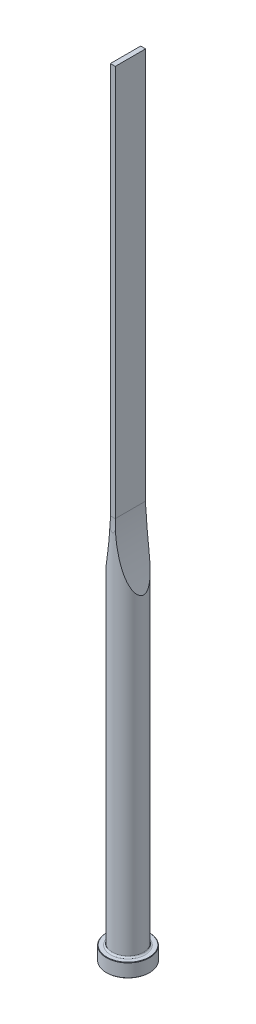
ISO-10303-21;
HEADER;
FILE_DESCRIPTION(('STEP AP214'),'2;1');
FILE_NAME('part.step','',(''),(''),'','','');
FILE_SCHEMA(('AUTOMOTIVE_DESIGN { 1 0 10303 214 1 1 1 1 }'));
ENDSEC;
DATA;
#1=APPLICATION_CONTEXT('core data for automotive mechanical design processes');
#2=APPLICATION_PROTOCOL_DEFINITION('international standard','automotive_design',2000,#1);
#3=PRODUCT_CONTEXT('',#1,'mechanical');
#4=PRODUCT('Part','Part','',(#3));
#5=PRODUCT_RELATED_PRODUCT_CATEGORY('part','',(#4));
#6=PRODUCT_DEFINITION_FORMATION('','',#4);
#7=PRODUCT_DEFINITION_CONTEXT('part definition',#1,'design');
#8=PRODUCT_DEFINITION('design','',#6,#7);
#9=PRODUCT_DEFINITION_SHAPE('','',#8);
#10=(LENGTH_UNIT() NAMED_UNIT(*) SI_UNIT(.MILLI.,.METRE.));
#11=(NAMED_UNIT(*) PLANE_ANGLE_UNIT() SI_UNIT($,.RADIAN.));
#12=(NAMED_UNIT(*) SI_UNIT($,.STERADIAN.) SOLID_ANGLE_UNIT());
#13=UNCERTAINTY_MEASURE_WITH_UNIT(LENGTH_MEASURE(1.E-05),#10,'distance_accuracy_value','');
#14=(GEOMETRIC_REPRESENTATION_CONTEXT(3) GLOBAL_UNCERTAINTY_ASSIGNED_CONTEXT((#13)) GLOBAL_UNIT_ASSIGNED_CONTEXT((#10,
#11,#12)) REPRESENTATION_CONTEXT('',''));
#15=CARTESIAN_POINT('',(0.,0.,0.));
#16=DIRECTION('',(0.,0.,1.));
#17=DIRECTION('',(1.,0.,0.));
#18=AXIS2_PLACEMENT_3D('',#15,#16,#17);
#19=CARTESIAN_POINT('',(0.,0.,0.));
#20=DIRECTION('',(0.,1.,0.));
#21=DIRECTION('',(-1.,0.,0.));
#22=AXIS2_PLACEMENT_3D('',#19,#20,#21);
#23=PLANE('',#22);
#24=CARTESIAN_POINT('',(0.,0.,0.));
#25=DIRECTION('',(0.,1.,0.));
#26=DIRECTION('',(-1.,0.,0.));
#27=AXIS2_PLACEMENT_3D('',#24,#25,#26);
#28=CIRCLE('',#27,10.8);
#29=CARTESIAN_POINT('',(-10.8,0.,0.));
#30=VERTEX_POINT('',#29);
#31=EDGE_CURVE('E133',#30,#30,#28,.T.);
#32=ORIENTED_EDGE('',*,*,#31,.F.);
#33=EDGE_LOOP('',(#32));
#34=FACE_BOUND('',#33,.T.);
#35=ADVANCED_FACE('F32',(#34),#23,.F.);
#36=CARTESIAN_POINT('',(0.,0.,0.));
#37=DIRECTION('',(0.,1.,0.));
#38=DIRECTION('',(-1.,0.,0.));
#39=AXIS2_PLACEMENT_3D('',#36,#37,#38);
#40=CONICAL_SURFACE('',#39,10.8,0.785398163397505);
#41=CARTESIAN_POINT('',(0.,0.199999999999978,0.));
#42=DIRECTION('',(0.,1.,0.));
#43=DIRECTION('',(-1.,0.,0.));
#44=AXIS2_PLACEMENT_3D('',#41,#42,#43);
#45=CIRCLE('',#44,11.);
#46=CARTESIAN_POINT('',(-11.,0.199999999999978,0.));
#47=VERTEX_POINT('',#46);
#48=EDGE_CURVE('E130',#47,#47,#45,.T.);
#49=ORIENTED_EDGE('',*,*,#48,.F.);
#50=EDGE_LOOP('',(#49));
#51=FACE_BOUND('',#50,.T.);
#52=ORIENTED_EDGE('',*,*,#31,.T.);
#53=EDGE_LOOP('',(#52));
#54=FACE_BOUND('',#53,.T.);
#55=ADVANCED_FACE('F171',(#51,#54),#40,.T.);
#56=CARTESIAN_POINT('',(0.,400.,0.));
#57=DIRECTION('',(0.,1.,0.));
#58=DIRECTION('',(-1.,0.,0.));
#59=AXIS2_PLACEMENT_3D('',#56,#57,#58);
#60=CYLINDRICAL_SURFACE('',#59,11.);
#61=CARTESIAN_POINT('',(0.,6.80000000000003,0.));
#62=DIRECTION('',(0.,1.,0.));
#63=DIRECTION('',(-1.,0.,0.));
#64=AXIS2_PLACEMENT_3D('',#61,#62,#63);
#65=CIRCLE('',#64,11.);
#66=CARTESIAN_POINT('',(-11.,6.80000000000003,0.));
#67=VERTEX_POINT('',#66);
#68=EDGE_CURVE('E127',#67,#67,#65,.T.);
#69=ORIENTED_EDGE('',*,*,#68,.F.);
#70=EDGE_LOOP('',(#69));
#71=FACE_BOUND('',#70,.T.);
#72=ORIENTED_EDGE('',*,*,#48,.T.);
#73=EDGE_LOOP('',(#72));
#74=FACE_BOUND('',#73,.T.);
#75=ADVANCED_FACE('F176',(#71,#74),#60,.T.);
#76=CARTESIAN_POINT('',(0.,6.80000000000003,0.));
#77=DIRECTION('',(0.,-1.,0.));
#78=DIRECTION('',(1.,0.,0.));
#79=AXIS2_PLACEMENT_3D('',#76,#77,#78);
#80=CONICAL_SURFACE('',#79,11.,0.785398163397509);
#81=CARTESIAN_POINT('',(0.,7.00000000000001,0.));
#82=DIRECTION('',(0.,1.,0.));
#83=DIRECTION('',(-1.,0.,0.));
#84=AXIS2_PLACEMENT_3D('',#81,#82,#83);
#85=CIRCLE('',#84,10.8);
#86=CARTESIAN_POINT('',(-10.8,7.00000000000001,0.));
#87=VERTEX_POINT('',#86);
#88=EDGE_CURVE('E124',#87,#87,#85,.T.);
#89=ORIENTED_EDGE('',*,*,#88,.F.);
#90=EDGE_LOOP('',(#89));
#91=FACE_BOUND('',#90,.T.);
#92=ORIENTED_EDGE('',*,*,#68,.T.);
#93=EDGE_LOOP('',(#92));
#94=FACE_BOUND('',#93,.T.);
#95=ADVANCED_FACE('F183',(#91,#94),#80,.T.);
#96=CARTESIAN_POINT('',(10.8,7.,0.));
#97=DIRECTION('',(0.,-1.,0.));
#98=DIRECTION('',(1.,0.,0.));
#99=AXIS2_PLACEMENT_3D('',#96,#97,#98);
#100=PLANE('',#99);
#101=CARTESIAN_POINT('',(0.,7.00000000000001,0.));
#102=DIRECTION('',(0.,1.,0.));
#103=DIRECTION('',(-1.,0.,0.));
#104=AXIS2_PLACEMENT_3D('',#101,#102,#103);
#105=CIRCLE('',#104,8.80000000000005);
#106=CARTESIAN_POINT('',(-8.80000000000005,7.00000000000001,0.));
#107=VERTEX_POINT('',#106);
#108=EDGE_CURVE('E121',#107,#107,#105,.T.);
#109=ORIENTED_EDGE('',*,*,#108,.F.);
#110=EDGE_LOOP('',(#109));
#111=FACE_BOUND('',#110,.T.);
#112=ORIENTED_EDGE('',*,*,#88,.T.);
#113=EDGE_LOOP('',(#112));
#114=FACE_BOUND('',#113,.T.);
#115=ADVANCED_FACE('F190',(#111,#114),#100,.F.);
#116=CARTESIAN_POINT('',(0.,7.8,0.));
#117=DIRECTION('',(0.,1.,0.));
#118=DIRECTION('',(-1.,0.,0.));
#119=AXIS2_PLACEMENT_3D('',#116,#117,#118);
#120=TOROIDAL_SURFACE('',#119,8.80000000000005,0.8);
#121=CARTESIAN_POINT('',(0.,7.79999999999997,0.));
#122=DIRECTION('',(0.,1.,0.));
#123=DIRECTION('',(-1.,0.,0.));
#124=AXIS2_PLACEMENT_3D('',#121,#122,#123);
#125=CIRCLE('',#124,8.00000000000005);
#126=CARTESIAN_POINT('',(-8.00000000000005,7.79999999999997,0.));
#127=VERTEX_POINT('',#126);
#128=EDGE_CURVE('E112',#127,#127,#125,.T.);
#129=ORIENTED_EDGE('',*,*,#128,.F.);
#130=EDGE_LOOP('',(#129));
#131=FACE_BOUND('',#130,.T.);
#132=ORIENTED_EDGE('',*,*,#108,.T.);
#133=EDGE_LOOP('',(#132));
#134=FACE_BOUND('',#133,.T.);
#135=ADVANCED_FACE('F168',(#131,#134),#120,.F.);
#136=CARTESIAN_POINT('',(0.,400.,0.));
#137=DIRECTION('',(0.,1.,0.));
#138=DIRECTION('',(-1.,0.,0.));
#139=AXIS2_PLACEMENT_3D('',#136,#137,#138);
#140=CYLINDRICAL_SURFACE('',#139,8.00000000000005);
#141=CARTESIAN_POINT('',(8.00000000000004,165.802960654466,0.));
#142=CARTESIAN_POINT('',(8.00000026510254,165.802960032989,0.0938122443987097));
#143=CARTESIAN_POINT('',(7.99834450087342,165.80698987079,0.187620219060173));
#144=CARTESIAN_POINT('',(7.99177963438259,165.822978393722,0.374456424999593));
#145=CARTESIAN_POINT('',(7.98686934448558,165.834939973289,0.467484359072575));
#146=CARTESIAN_POINT('',(7.96742702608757,165.882346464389,0.744490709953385));
#147=CARTESIAN_POINT('',(7.94818381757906,165.929312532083,0.926267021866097));
#148=CARTESIAN_POINT('',(7.89369415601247,166.062816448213,1.31794712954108));
#149=CARTESIAN_POINT('',(7.85585748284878,166.155789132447,1.52523495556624));
#150=CARTESIAN_POINT('',(7.76860681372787,166.371582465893,1.92093916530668));
#151=CARTESIAN_POINT('',(7.71917225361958,166.494456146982,2.10932117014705));
#152=CARTESIAN_POINT('',(7.62330404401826,166.734568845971,2.43048963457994));
#153=CARTESIAN_POINT('',(7.57832229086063,166.847826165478,2.56676942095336));
#154=CARTESIAN_POINT('',(7.48466719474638,167.085181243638,2.82826049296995));
#155=CARTESIAN_POINT('',(7.43599151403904,167.209285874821,2.95346465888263));
#156=CARTESIAN_POINT('',(7.33595072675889,167.466150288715,3.19386992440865));
#157=CARTESIAN_POINT('',(7.28458133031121,167.598923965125,3.30905424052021));
#158=CARTESIAN_POINT('',(7.17999527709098,167.871265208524,3.53024569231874));
#159=CARTESIAN_POINT('',(7.12677789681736,168.010835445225,3.63624917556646));
#160=CARTESIAN_POINT('',(7.01894146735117,168.295866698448,3.84028904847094));
#161=CARTESIAN_POINT('',(6.9643184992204,168.441345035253,3.93829903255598));
#162=CARTESIAN_POINT('',(6.85428087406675,168.736803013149,4.12683031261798));
#163=CARTESIAN_POINT('',(6.79886605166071,168.886783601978,4.21735001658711));
#164=CARTESIAN_POINT('',(6.63190545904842,169.342495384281,4.47892704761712));
#165=CARTESIAN_POINT('',(6.51971379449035,169.653811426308,4.63987327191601));
#166=CARTESIAN_POINT('',(6.29541385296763,170.287516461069,4.93992334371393));
#167=CARTESIAN_POINT('',(6.18330624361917,170.609927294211,5.07898070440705));
#168=CARTESIAN_POINT('',(6.01631941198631,171.099317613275,5.27362914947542));
#169=CARTESIAN_POINT('',(5.96086316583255,171.263378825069,5.33617863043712));
#170=CARTESIAN_POINT('',(5.85043562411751,171.593228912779,5.45702390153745));
#171=CARTESIAN_POINT('',(5.79546434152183,171.75901783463,5.51531957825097));
#172=CARTESIAN_POINT('',(5.65519725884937,172.186244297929,5.65984603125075));
#173=CARTESIAN_POINT('',(5.57032289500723,172.448780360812,5.74324284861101));
#174=CARTESIAN_POINT('',(5.40227851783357,172.976944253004,5.90158511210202));
#175=CARTESIAN_POINT('',(5.31910869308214,173.242572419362,5.97652962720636));
#176=CARTESIAN_POINT('',(5.1546619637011,173.776521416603,6.11892936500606));
#177=CARTESIAN_POINT('',(5.07338579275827,174.044843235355,6.18638172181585));
#178=CARTESIAN_POINT('',(4.91291989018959,174.583712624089,6.31456619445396));
#179=CARTESIAN_POINT('',(4.8337302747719,174.854260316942,6.37529793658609));
#180=CARTESIAN_POINT('',(4.59921321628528,175.669743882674,6.54867925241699));
#181=CARTESIAN_POINT('',(4.44722690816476,176.217581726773,6.65227031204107));
#182=CARTESIAN_POINT('',(4.15294399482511,177.318997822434,6.83984073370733));
#183=CARTESIAN_POINT('',(4.01064567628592,177.87257503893,6.92382356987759));
#184=CARTESIAN_POINT('',(3.73548723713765,178.987119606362,7.07608447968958));
#185=CARTESIAN_POINT('',(3.6026766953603,179.548109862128,7.14428371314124));
#186=CARTESIAN_POINT('',(3.34757576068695,180.673929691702,7.26730852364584));
#187=CARTESIAN_POINT('',(3.22528566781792,181.238759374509,7.32213371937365));
#188=CARTESIAN_POINT('',(2.99154866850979,182.371056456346,7.42069405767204));
#189=CARTESIAN_POINT('',(2.88009178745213,182.938520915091,7.46443946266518));
#190=CARTESIAN_POINT('',(2.66803590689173,184.076105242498,7.54283474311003));
#191=CARTESIAN_POINT('',(2.5674371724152,184.64622517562,7.57748439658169));
#192=CARTESIAN_POINT('',(2.37380329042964,185.809107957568,7.64040492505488));
#193=CARTESIAN_POINT('',(2.28116700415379,186.401951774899,7.66840353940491));
#194=CARTESIAN_POINT('',(2.10773403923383,187.58965672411,7.71787436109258));
#195=CARTESIAN_POINT('',(2.02693779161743,188.184517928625,7.73934633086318));
#196=CARTESIAN_POINT('',(1.87723712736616,189.375979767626,7.77701336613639));
#197=CARTESIAN_POINT('',(1.80833431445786,189.972580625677,7.79320772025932));
#198=CARTESIAN_POINT('',(1.68247616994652,191.167141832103,7.82134453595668));
#199=CARTESIAN_POINT('',(1.62552089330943,191.765102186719,7.8332869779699));
#200=CARTESIAN_POINT('',(1.52353769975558,192.962706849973,7.85375958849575));
#201=CARTESIAN_POINT('',(1.47852193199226,193.562352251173,7.8622862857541));
#202=CARTESIAN_POINT('',(1.40051616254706,194.7624584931,7.87655546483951));
#203=CARTESIAN_POINT('',(1.36752619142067,195.362919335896,7.88229793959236));
#204=CARTESIAN_POINT('',(1.31358947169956,196.564358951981,7.89146568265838));
#205=CARTESIAN_POINT('',(1.29264192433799,197.165337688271,7.89489110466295));
#206=CARTESIAN_POINT('',(1.26279614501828,198.367601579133,7.8997198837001));
#207=CARTESIAN_POINT('',(1.25389790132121,198.968886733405,7.90112324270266));
#208=CARTESIAN_POINT('',(1.24815287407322,200.171883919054,7.90203283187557));
#209=CARTESIAN_POINT('',(1.25131346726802,200.773595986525,7.90153790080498));
#210=CARTESIAN_POINT('',(1.269701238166,201.976831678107,7.89860402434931));
#211=CARTESIAN_POINT('',(1.28492842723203,202.578355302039,7.89616507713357));
#212=CARTESIAN_POINT('',(1.3274439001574,203.781000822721,7.88912905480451));
#213=CARTESIAN_POINT('',(1.35473292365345,204.382122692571,7.8845318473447));
#214=CARTESIAN_POINT('',(1.42135959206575,205.583672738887,7.8727937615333));
#215=CARTESIAN_POINT('',(1.46069720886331,206.184100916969,7.86565288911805));
#216=CARTESIAN_POINT('',(1.55135792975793,207.383420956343,7.84827481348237));
#217=CARTESIAN_POINT('',(1.60266934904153,207.982313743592,7.838040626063));
#218=CARTESIAN_POINT('',(1.71727134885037,209.178873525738,7.81373223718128));
#219=CARTESIAN_POINT('',(1.78056188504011,209.776540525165,7.79965804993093));
#220=CARTESIAN_POINT('',(1.91907692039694,210.970286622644,7.76673757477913));
#221=CARTESIAN_POINT('',(1.9942999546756,211.56636590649,7.74789187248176));
#222=CARTESIAN_POINT('',(2.15663252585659,212.756670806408,7.7042846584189));
#223=CARTESIAN_POINT('',(2.24374167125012,213.350896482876,7.67952334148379));
#224=CARTESIAN_POINT('',(2.42976271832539,214.537048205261,7.62271037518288));
#225=CARTESIAN_POINT('',(2.52867257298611,215.128974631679,7.59065998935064));
#226=CARTESIAN_POINT('',(2.73820717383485,216.310190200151,7.5176151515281));
#227=CARTESIAN_POINT('',(2.84883162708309,216.899479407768,7.47662092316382));
#228=CARTESIAN_POINT('',(3.08176087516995,218.075430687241,7.38366415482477));
#229=CARTESIAN_POINT('',(3.2040758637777,218.662089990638,7.3316919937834));
#230=CARTESIAN_POINT('',(3.46009921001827,219.831580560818,7.21439925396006));
#231=CARTESIAN_POINT('',(3.59380724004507,220.414411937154,7.14907905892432));
#232=CARTESIAN_POINT('',(3.87131633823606,221.571205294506,7.0026675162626));
#233=CARTESIAN_POINT('',(4.01503806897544,222.145200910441,6.92169274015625));
#234=CARTESIAN_POINT('',(4.31300927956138,223.287506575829,6.74006510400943));
#235=CARTESIAN_POINT('',(4.46726059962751,223.855815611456,6.63940879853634));
#236=CARTESIAN_POINT('',(4.70582882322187,224.702069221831,6.47028575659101));
#237=CARTESIAN_POINT('',(4.78647968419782,224.982886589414,6.4109454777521));
#238=CARTESIAN_POINT('',(4.95008800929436,225.542319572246,6.28548116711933));
#239=CARTESIAN_POINT('',(5.03304534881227,225.820935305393,6.21935750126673));
#240=CARTESIAN_POINT('',(5.20107759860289,226.375497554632,6.07953381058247));
#241=CARTESIAN_POINT('',(5.28615168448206,226.65144505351,6.00583670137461));
#242=CARTESIAN_POINT('',(5.45823411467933,227.200286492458,5.84988654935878));
#243=CARTESIAN_POINT('',(5.54524223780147,227.473180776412,5.76763448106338));
#244=CARTESIAN_POINT('',(5.67806423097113,227.883061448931,5.63591979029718));
#245=CARTESIAN_POINT('',(5.72326667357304,228.021401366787,5.59003697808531));
#246=CARTESIAN_POINT('',(5.81405871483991,228.297013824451,5.49554477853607));
#247=CARTESIAN_POINT('',(5.85964830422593,228.434286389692,5.44693545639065));
#248=CARTESIAN_POINT('',(5.99693707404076,228.844381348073,5.29671475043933));
#249=CARTESIAN_POINT('',(6.08914683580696,229.115451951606,5.19071986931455));
#250=CARTESIAN_POINT('',(6.27444481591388,229.651907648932,4.96514550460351));
#251=CARTESIAN_POINT('',(6.36753373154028,229.917287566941,4.84555422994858));
#252=CARTESIAN_POINT('',(6.55371367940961,230.440368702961,4.59061900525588));
#253=CARTESIAN_POINT('',(6.6468047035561,230.698072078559,4.45527953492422));
#254=CARTESIAN_POINT('',(6.80461930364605,231.128986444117,4.20854013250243));
#255=CARTESIAN_POINT('',(6.86963437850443,231.30475796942,4.10180464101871));
#256=CARTESIAN_POINT('',(6.99849309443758,231.649920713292,3.87785953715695));
#257=CARTESIAN_POINT('',(7.06233704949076,231.819313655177,3.76065278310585));
#258=CARTESIAN_POINT('',(7.18797318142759,232.149756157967,3.51455569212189));
#259=CARTESIAN_POINT('',(7.24976878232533,232.310819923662,3.38568635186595));
#260=CARTESIAN_POINT('',(7.37029409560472,232.622428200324,3.11460298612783));
#261=CARTESIAN_POINT('',(7.42902581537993,232.772979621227,2.97239787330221));
#262=CARTESIAN_POINT('',(7.54920486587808,233.078802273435,2.65370528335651));
#263=CARTESIAN_POINT('',(7.61003609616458,233.232207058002,2.47515980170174));
#264=CARTESIAN_POINT('',(7.72278712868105,233.514590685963,2.09698763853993));
#265=CARTESIAN_POINT('',(7.7747172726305,233.643597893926,1.89738586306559));
#266=CARTESIAN_POINT('',(7.85662422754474,233.846040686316,1.51771631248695));
#267=CARTESIAN_POINT('',(7.88890499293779,233.925400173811,1.34135369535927));
#268=CARTESIAN_POINT('',(7.9422571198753,234.056203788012,0.97690134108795));
#269=CARTESIAN_POINT('',(7.96334089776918,234.107678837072,0.788824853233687));
#270=CARTESIAN_POINT('',(7.99214354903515,234.177929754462,0.403868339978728));
#271=CARTESIAN_POINT('',(7.99975120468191,234.196433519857,0.206928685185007));
#272=CARTESIAN_POINT('',(8.00023647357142,234.197615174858,-0.187071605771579));
#273=CARTESIAN_POINT('',(7.99311624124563,234.180298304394,-0.384132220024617));
#274=CARTESIAN_POINT('',(7.96684480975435,234.116227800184,-0.747314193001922));
#275=CARTESIAN_POINT('',(7.94927624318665,234.073344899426,-0.914265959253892));
#276=CARTESIAN_POINT('',(7.9051150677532,233.965181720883,-1.23939979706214));
#277=CARTESIAN_POINT('',(7.87851864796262,233.899891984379,-1.39757813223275));
#278=CARTESIAN_POINT('',(7.80150655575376,233.710002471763,-1.78741131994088));
#279=CARTESIAN_POINT('',(7.74602888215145,233.572516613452,-2.01175610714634));
#280=CARTESIAN_POINT('',(7.62368478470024,233.266599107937,-2.43480475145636));
#281=CARTESIAN_POINT('',(7.55678605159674,233.098079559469,-2.63343297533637));
#282=CARTESIAN_POINT('',(7.42485305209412,232.762373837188,-2.98360814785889));
#283=CARTESIAN_POINT('',(7.36064911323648,232.597703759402,-3.13793327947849));
#284=CARTESIAN_POINT('',(7.22873319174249,232.256166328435,-3.43092689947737));
#285=CARTESIAN_POINT('',(7.16101842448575,232.079289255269,-3.5695826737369));
#286=CARTESIAN_POINT('',(7.02335239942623,231.716078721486,-3.83336433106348));
#287=CARTESIAN_POINT('',(6.9533971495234,231.529727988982,-3.95846409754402));
#288=CARTESIAN_POINT('',(6.81234217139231,231.150007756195,-4.19656018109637));
#289=CARTESIAN_POINT('',(6.74124277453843,230.956640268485,-4.30955993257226));
#290=CARTESIAN_POINT('',(6.57376514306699,230.496135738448,-4.56245246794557));
#291=CARTESIAN_POINT('',(6.47718857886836,230.226715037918,-4.69804436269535));
#292=CARTESIAN_POINT('',(6.2842983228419,229.680189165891,-4.953092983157));
#293=CARTESIAN_POINT('',(6.18798476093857,229.403080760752,-5.07254279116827));
#294=CARTESIAN_POINT('',(5.99627862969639,228.842518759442,-5.29778630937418));
#295=CARTESIAN_POINT('',(5.90088780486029,228.5590556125,-5.40355758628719));
#296=CARTESIAN_POINT('',(5.71175237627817,227.987476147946,-5.6031034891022));
#297=CARTESIAN_POINT('',(5.61800754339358,227.699360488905,-5.69687979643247));
#298=CARTESIAN_POINT('',(5.43210994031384,227.117952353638,-5.87441675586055));
#299=CARTESIAN_POINT('',(5.33996671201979,226.824641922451,-5.9581283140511));
#300=CARTESIAN_POINT('',(5.15802018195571,226.234829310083,-6.11631871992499));
#301=CARTESIAN_POINT('',(5.06821693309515,225.938327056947,-6.19079735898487));
#302=CARTESIAN_POINT('',(4.89125436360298,225.342916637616,-6.33153994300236));
#303=CARTESIAN_POINT('',(4.80409269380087,225.044010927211,-6.39781135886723));
#304=CARTESIAN_POINT('',(4.63249445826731,224.443918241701,-6.52313376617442));
#305=CARTESIAN_POINT('',(4.54805792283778,224.142731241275,-6.58218467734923));
#306=CARTESIAN_POINT('',(4.3420444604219,223.392794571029,-6.72076328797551));
#307=CARTESIAN_POINT('',(4.22217368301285,222.942864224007,-6.79644911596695));
#308=CARTESIAN_POINT('',(3.98900738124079,222.03943889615,-6.93586698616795));
#309=CARTESIAN_POINT('',(3.87571251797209,221.585943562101,-6.99959782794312));
#310=CARTESIAN_POINT('',(3.65588836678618,220.675851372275,-7.11688148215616));
#311=CARTESIAN_POINT('',(3.5493613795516,220.219253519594,-7.1704308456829));
#312=CARTESIAN_POINT('',(3.34326760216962,219.303540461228,-7.26880963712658));
#313=CARTESIAN_POINT('',(3.24370115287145,218.844425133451,-7.31363863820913));
#314=CARTESIAN_POINT('',(3.05148006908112,217.923248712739,-7.3959056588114));
#315=CARTESIAN_POINT('',(2.95883785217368,217.461183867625,-7.43333058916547));
#316=CARTESIAN_POINT('',(2.78074133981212,216.535192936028,-7.50177003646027));
#317=CARTESIAN_POINT('',(2.69528727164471,216.071266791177,-7.53278435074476));
#318=CARTESIAN_POINT('',(2.44984201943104,214.677263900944,-7.61763803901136));
#319=CARTESIAN_POINT('',(2.30072330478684,213.744749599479,-7.66330625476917));
#320=CARTESIAN_POINT('',(2.03152927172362,211.872701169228,-7.73901783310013));
#321=CARTESIAN_POINT('',(1.91152385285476,210.933155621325,-7.76902378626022));
#322=CARTESIAN_POINT('',(1.70120365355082,209.050431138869,-7.81777190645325));
#323=CARTESIAN_POINT('',(1.61088985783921,208.10725208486,-7.8365136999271));
#324=CARTESIAN_POINT('',(1.46015730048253,206.219327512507,-7.86599149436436));
#325=CARTESIAN_POINT('',(1.39970918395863,205.274584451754,-7.87673536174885));
#326=CARTESIAN_POINT('',(1.30864636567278,203.383624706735,-7.89237400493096));
#327=CARTESIAN_POINT('',(1.27803147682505,202.437408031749,-7.89726881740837));
#328=CARTESIAN_POINT('',(1.24538021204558,200.466676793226,-7.90249069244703));
#329=CARTESIAN_POINT('',(1.24589914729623,199.442117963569,-7.90240932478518));
#330=CARTESIAN_POINT('',(1.28191589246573,197.393606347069,-7.89664606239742));
#331=CARTESIAN_POINT('',(1.31741455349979,196.36965357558,-7.89096403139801));
#332=CARTESIAN_POINT('',(1.42339546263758,194.322628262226,-7.87253686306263));
#333=CARTESIAN_POINT('',(1.49391165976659,193.299557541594,-7.85978487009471));
#334=CARTESIAN_POINT('',(1.66984675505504,191.256594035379,-7.82430364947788));
#335=CARTESIAN_POINT('',(1.77526429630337,190.236701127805,-7.8015748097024));
#336=CARTESIAN_POINT('',(1.95904103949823,188.713544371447,-7.75667598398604));
#337=CARTESIAN_POINT('',(2.02433095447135,188.208510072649,-7.739977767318));
#338=CARTESIAN_POINT('',(2.16344843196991,187.199784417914,-7.70225341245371));
#339=CARTESIAN_POINT('',(2.23727579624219,186.696093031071,-7.68122737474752));
#340=CARTESIAN_POINT('',(2.39344097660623,185.690176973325,-7.63400890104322));
#341=CARTESIAN_POINT('',(2.47578036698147,185.187952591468,-7.60781550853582));
#342=CARTESIAN_POINT('',(2.64890138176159,184.185319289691,-7.54928305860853));
#343=CARTESIAN_POINT('',(2.7396829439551,183.68491035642,-7.51694404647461));
#344=CARTESIAN_POINT('',(2.92946025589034,182.687004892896,-7.44503494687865));
#345=CARTESIAN_POINT('',(3.02844258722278,182.189504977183,-7.40547654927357));
#346=CARTESIAN_POINT('',(3.23464757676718,181.196950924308,-7.31776024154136));
#347=CARTESIAN_POINT('',(3.34187049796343,180.701896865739,-7.26960205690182));
#348=CARTESIAN_POINT('',(3.56436615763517,179.714896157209,-7.16313487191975));
#349=CARTESIAN_POINT('',(3.67963572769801,179.222948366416,-7.10482985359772));
#350=CARTESIAN_POINT('',(3.91805446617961,178.242571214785,-6.97618941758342));
#351=CARTESIAN_POINT('',(4.04120279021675,177.754141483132,-6.9058552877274));
#352=CARTESIAN_POINT('',(4.21329367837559,177.09489738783,-6.80080442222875));
#353=CARTESIAN_POINT('',(4.25892375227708,176.922207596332,-6.77233773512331));
#354=CARTESIAN_POINT('',(4.35112638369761,176.577412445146,-6.71347097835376));
#355=CARTESIAN_POINT('',(4.39769892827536,176.405307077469,-6.6830709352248));
#356=CARTESIAN_POINT('',(4.53880698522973,175.889921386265,-6.58878186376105));
#357=CARTESIAN_POINT('',(4.63473141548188,175.547577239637,-6.5218048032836));
#358=CARTESIAN_POINT('',(4.83032143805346,174.865054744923,-6.37830273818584));
#359=CARTESIAN_POINT('',(4.92999531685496,174.524883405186,-6.3017555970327));
#360=CARTESIAN_POINT('',(5.13261190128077,173.848131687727,-6.13785597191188));
#361=CARTESIAN_POINT('',(5.23555450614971,173.511551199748,-6.0505038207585));
#362=CARTESIAN_POINT('',(5.46071992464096,172.790377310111,-5.84866445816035));
#363=CARTESIAN_POINT('',(5.58343680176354,172.406522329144,-5.73207009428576));
#364=CARTESIAN_POINT('',(5.83207198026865,171.646209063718,-5.47891377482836));
#365=CARTESIAN_POINT('',(5.95799150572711,171.26975370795,-5.3423440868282));
#366=CARTESIAN_POINT('',(6.14807410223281,170.713475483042,-5.11962998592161));
#367=CARTESIAN_POINT('',(6.21152554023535,170.529758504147,-5.04256291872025));
#368=CARTESIAN_POINT('',(6.33868335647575,170.165363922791,-4.88176358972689));
#369=CARTESIAN_POINT('',(6.4023897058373,169.984685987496,-4.79803206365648));
#370=CARTESIAN_POINT('',(6.52974372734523,169.627081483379,-4.62321652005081));
#371=CARTESIAN_POINT('',(6.59339140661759,169.45015210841,-4.53213826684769));
#372=CARTESIAN_POINT('',(6.72031795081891,169.100689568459,-4.34170775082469));
#373=CARTESIAN_POINT('',(6.78359689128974,168.928155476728,-4.24235725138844));
#374=CARTESIAN_POINT('',(6.89274570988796,168.633274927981,-4.06177950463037));
#375=CARTESIAN_POINT('',(6.93880530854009,168.509693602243,-3.9826834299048));
#376=CARTESIAN_POINT('',(7.03023814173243,168.265970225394,-3.81897184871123));
#377=CARTESIAN_POINT('',(7.0756113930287,168.145828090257,-3.7343564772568));
#378=CARTESIAN_POINT('',(7.16545377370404,167.909423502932,-3.55893242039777));
#379=CARTESIAN_POINT('',(7.20992117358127,167.793168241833,-3.46811310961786));
#380=CARTESIAN_POINT('',(7.2974837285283,167.56560658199,-3.27986458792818));
#381=CARTESIAN_POINT('',(7.34057904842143,167.454299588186,-3.18243617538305));
#382=CARTESIAN_POINT('',(7.42541230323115,167.236418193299,-2.97917893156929));
#383=CARTESIAN_POINT('',(7.46712917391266,167.129912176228,-2.87326702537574));
#384=CARTESIAN_POINT('',(7.54802591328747,166.924453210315,-2.65349674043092));
#385=CARTESIAN_POINT('',(7.58720523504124,166.825501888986,-2.53963665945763));
#386=CARTESIAN_POINT('',(7.69959293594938,166.543012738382,-2.18570913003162));
#387=CARTESIAN_POINT('',(7.7680050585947,166.372934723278,-1.93248529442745));
#388=CARTESIAN_POINT('',(7.8606823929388,166.143969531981,-1.49614758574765));
#389=CARTESIAN_POINT('',(7.89179585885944,166.067502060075,-1.32369077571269));
#390=CARTESIAN_POINT('',(7.94325969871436,165.941349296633,-0.967818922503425));
#391=CARTESIAN_POINT('',(7.96363765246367,165.891595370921,-0.784433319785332));
#392=CARTESIAN_POINT('',(7.9850074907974,165.839476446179,-0.499467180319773));
#393=CARTESIAN_POINT('',(7.9906098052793,165.825828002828,-0.400188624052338));
#394=CARTESIAN_POINT('',(7.99810642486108,165.807569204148,-0.200605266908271));
#395=CARTESIAN_POINT('',(7.99999971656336,165.802961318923,-0.100300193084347));
#396=CARTESIAN_POINT('',(8.00000000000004,165.802960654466,0.));
#397=B_SPLINE_CURVE_WITH_KNOTS('',3,(#141,#142,#143,#144,#145,#146,#147,#148,#149,#150,#151,
#152,#153,#154,#155,#156,#157,#158,#159,#160,#161,#162,#163,#164,#165,#166,#167,#168,#169,#170,
#171,#172,#173,#174,#175,#176,#177,#178,#179,#180,#181,#182,#183,#184,#185,#186,#187,#188,#189,
#190,#191,#192,#193,#194,#195,#196,#197,#198,#199,#200,#201,#202,#203,#204,#205,#206,#207,#208,
#209,#210,#211,#212,#213,#214,#215,#216,#217,#218,#219,#220,#221,#222,#223,#224,#225,#226,#227,
#228,#229,#230,#231,#232,#233,#234,#235,#236,#237,#238,#239,#240,#241,#242,#243,#244,#245,#246,
#247,#248,#249,#250,#251,#252,#253,#254,#255,#256,#257,#258,#259,#260,#261,#262,#263,#264,#265,
#266,#267,#268,#269,#270,#271,#272,#273,#274,#275,#276,#277,#278,#279,#280,#281,#282,#283,#284,
#285,#286,#287,#288,#289,#290,#291,#292,#293,#294,#295,#296,#297,#298,#299,#300,#301,#302,#303,
#304,#305,#306,#307,#308,#309,#310,#311,#312,#313,#314,#315,#316,#317,#318,#319,#320,#321,#322,
#323,#324,#325,#326,#327,#328,#329,#330,#331,#332,#333,#334,#335,#336,#337,#338,#339,#340,#341,
#342,#343,#344,#345,#346,#347,#348,#349,#350,#351,#352,#353,#354,#355,#356,#357,#358,#359,#360,
#361,#362,#363,#364,#365,#366,#367,#368,#369,#370,#371,#372,#373,#374,#375,#376,#377,#378,#379,
#380,#381,#382,#383,#384,#385,#386,#387,#388,#389,#390,#391,#392,#393,#394,#395,#396),
.UNSPECIFIED.,.T.,.F.,(4,2,2,2,2,2,2,2,2,2,2,2,2,2,2,2,2,2,2,2,2,2,2,2,2,2,2,2,2,2,2,2,2,2,2,2,
2,2,2,2,2,2,2,2,2,2,2,2,2,2,2,2,2,2,2,2,2,2,2,2,2,2,2,2,2,2,2,2,2,2,2,2,2,2,2,2,2,2,2,2,2,2,2,2,
2,2,2,2,2,2,2,2,2,2,2,2,2,2,2,2,2,2,2,2,2,2,2,2,2,2,2,2,2,2,2,2,2,2,2,2,2,2,2,2,2,2,2,4),(0.,
0.281321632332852,0.562745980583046,1.12596306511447,1.81315351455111,2.50157175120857,
3.04927977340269,3.59733735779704,4.14629595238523,4.69547194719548,5.24639421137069,
5.79743327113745,6.90021798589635,8.00531404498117,8.55765540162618,9.11001148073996,
9.97456303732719,10.8392097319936,11.7041860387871,12.5692104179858,14.3022923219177,
16.0350669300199,17.7763185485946,19.5176198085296,21.2573022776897,22.9970271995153,
24.7989344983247,26.6009073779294,28.4031230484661,30.205347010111,32.0093978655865,
33.8134533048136,35.6173890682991,37.4213230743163,39.2263607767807,41.0314001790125,
42.8365502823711,44.64169617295,46.4450877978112,48.2484727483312,50.051636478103,
51.8547408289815,53.6575328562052,55.4602798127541,57.264613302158,59.068894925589,
60.8602253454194,62.6518696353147,63.5461976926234,64.440477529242,65.3344143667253,
66.2282494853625,66.6860206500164,67.1437808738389,68.0593969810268,68.9758132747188,
69.8919695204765,70.5387023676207,71.1852592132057,71.8306743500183,72.4756611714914,
73.203281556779,73.930050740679,74.5160460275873,75.1013901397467,75.6915429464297,
76.2816094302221,76.7993074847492,77.3172243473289,78.1193408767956,78.9237653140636,
79.6266625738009,80.330126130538,81.0349217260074,81.7395167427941,82.6889693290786,
83.6388275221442,84.5902242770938,85.5414875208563,86.4972172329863,87.4529685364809,
88.4078433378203,89.3627287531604,90.7776786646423,92.1927705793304,93.6083409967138,
95.0239806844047,96.4421010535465,97.8602662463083,100.695941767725,103.538359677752,
106.380871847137,109.220584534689,112.060279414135,115.133337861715,118.20647108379,
121.282589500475,124.358588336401,125.887046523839,127.415469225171,128.944175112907,
130.47286973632,131.999110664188,133.525400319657,135.051092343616,136.576621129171,
137.119222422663,137.661816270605,138.747022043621,139.83478613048,140.922516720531,
142.180644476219,143.439260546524,144.066418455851,144.69350722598,145.32010867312,
145.946576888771,146.407814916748,146.869041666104,147.331079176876,147.793060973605,
148.260307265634,148.727653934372,149.658588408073,150.230255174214,150.80044606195,
151.101141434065,151.401918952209),.UNSPECIFIED.);
#398=CARTESIAN_POINT('',(1.38006479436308,195.163188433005,-7.88006479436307));
#399=VERTEX_POINT('',#398);
#400=CARTESIAN_POINT('',(1.38006479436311,195.163188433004,7.88006479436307));
#401=VERTEX_POINT('',#400);
#402=EDGE_CURVE('E138',#399,#401,#397,.T.);
#403=ORIENTED_EDGE('',*,*,#402,.T.);
#404=CARTESIAN_POINT('',(-1.98431348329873,200.,7.74999999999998));
#405=CARTESIAN_POINT('',(-1.98431671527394,200.310227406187,7.75000012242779));
#406=CARTESIAN_POINT('',(-1.97807758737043,200.620470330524,7.75160504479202));
#407=CARTESIAN_POINT('',(-1.95278869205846,201.240402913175,7.75801423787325));
#408=CARTESIAN_POINT('',(-1.93373880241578,201.550092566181,7.76281853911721));
#409=CARTESIAN_POINT('',(-1.88170740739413,202.168545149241,7.77559741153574));
#410=CARTESIAN_POINT('',(-1.84871351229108,202.477307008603,7.78357480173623));
#411=CARTESIAN_POINT('',(-1.76661059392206,203.092457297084,7.80261881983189));
#412=CARTESIAN_POINT('',(-1.71750945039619,203.398846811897,7.81368393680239));
#413=CARTESIAN_POINT('',(-1.59923669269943,204.00782620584,7.83876619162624));
#414=CARTESIAN_POINT('',(-1.53006503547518,204.310416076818,7.85278333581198));
#415=CARTESIAN_POINT('',(-1.40509547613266,204.758317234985,7.87574985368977));
#416=CARTESIAN_POINT('',(-1.35990520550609,204.906616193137,7.8837285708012));
#417=CARTESIAN_POINT('',(-1.26052233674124,205.200044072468,7.90023035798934));
#418=CARTESIAN_POINT('',(-1.20633656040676,205.345175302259,7.90875301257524));
#419=CARTESIAN_POINT('',(-1.08563979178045,205.631320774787,7.92623499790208));
#420=CARTESIAN_POINT('',(-1.01906689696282,205.77231003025,7.93519634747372));
#421=CARTESIAN_POINT('',(-0.905913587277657,205.976517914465,7.94863066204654));
#422=CARTESIAN_POINT('',(-0.865970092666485,206.043388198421,7.95310844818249));
#423=CARTESIAN_POINT('',(-0.780477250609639,206.173411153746,7.96195394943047));
#424=CARTESIAN_POINT('',(-0.734935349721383,206.236568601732,7.96632180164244));
#425=CARTESIAN_POINT('',(-0.63609346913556,206.357858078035,7.97482874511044));
#426=CARTESIAN_POINT('',(-0.582709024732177,206.415922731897,7.97896456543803));
#427=CARTESIAN_POINT('',(-0.466606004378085,206.521734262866,7.9865901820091));
#428=CARTESIAN_POINT('',(-0.403961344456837,206.569556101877,7.99008464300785));
#429=CARTESIAN_POINT('',(-0.303890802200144,206.626684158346,7.99429035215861));
#430=CARTESIAN_POINT('',(-0.27053575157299,206.643017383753,7.99549865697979));
#431=CARTESIAN_POINT('',(-0.201689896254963,206.670421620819,7.99753116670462));
#432=CARTESIAN_POINT('',(-0.166200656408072,206.681496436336,7.99835564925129));
#433=CARTESIAN_POINT('',(-0.0934740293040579,206.697347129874,7.99953699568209));
#434=CARTESIAN_POINT('',(-0.0562242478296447,206.702068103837,7.99988978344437));
#435=CARTESIAN_POINT('',(0.0184986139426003,206.704424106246,8.00006574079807));
#436=CARTESIAN_POINT('',(0.0559716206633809,206.702061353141,7.99988907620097));
#437=CARTESIAN_POINT('',(0.126456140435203,206.691099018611,7.99907121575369));
#438=CARTESIAN_POINT('',(0.159563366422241,206.683086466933,7.99847374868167));
#439=CARTESIAN_POINT('',(0.224196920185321,206.662232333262,7.99692334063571));
#440=CARTESIAN_POINT('',(0.255722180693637,206.649387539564,7.99597016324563));
#441=CARTESIAN_POINT('',(0.334694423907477,206.611135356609,7.99314270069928));
#442=CARTESIAN_POINT('',(0.38069252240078,206.582771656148,7.9910555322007));
#443=CARTESIAN_POINT('',(0.467817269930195,206.519390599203,7.98642960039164));
#444=CARTESIAN_POINT('',(0.508928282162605,206.484352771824,7.98388944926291));
#445=CARTESIAN_POINT('',(0.621519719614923,206.376791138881,7.9761651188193));
#446=CARTESIAN_POINT('',(0.687515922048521,206.298628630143,7.97063757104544));
#447=CARTESIAN_POINT('',(0.808549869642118,206.134392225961,7.95926471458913));
#448=CARTESIAN_POINT('',(0.863553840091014,206.048295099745,7.95341849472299));
#449=CARTESIAN_POINT('',(0.995128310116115,205.820249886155,7.93828495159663));
#450=CARTESIAN_POINT('',(1.06569888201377,205.674876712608,7.92896886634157));
#451=CARTESIAN_POINT('',(1.19356521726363,205.3782856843,7.91071942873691));
#452=CARTESIAN_POINT('',(1.25082971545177,205.227055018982,7.90178701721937));
#453=CARTESIAN_POINT('',(1.3557073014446,204.920417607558,7.88447171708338));
#454=CARTESIAN_POINT('',(1.40326961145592,204.764993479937,7.87609186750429));
#455=CARTESIAN_POINT('',(1.49048759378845,204.45213217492,7.86005026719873));
#456=CARTESIAN_POINT('',(1.53015172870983,204.294697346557,7.85238775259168));
#457=CARTESIAN_POINT('',(1.62389561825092,203.887904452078,7.83367180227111));
#458=CARTESIAN_POINT('',(1.67325812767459,203.637435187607,7.82318329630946));
#459=CARTESIAN_POINT('',(1.75948004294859,203.134239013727,7.8042383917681));
#460=CARTESIAN_POINT('',(1.79633420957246,202.881511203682,7.79578284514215));
#461=CARTESIAN_POINT('',(1.8594796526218,202.374226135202,7.78096344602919));
#462=CARTESIAN_POINT('',(1.88575180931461,202.119666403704,7.77460338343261));
#463=CARTESIAN_POINT('',(1.92879038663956,201.609697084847,7.76403451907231));
#464=CARTESIAN_POINT('',(1.94555558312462,201.3542873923,7.75982599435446));
#465=CARTESIAN_POINT('',(1.98269985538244,200.587295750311,7.75046498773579));
#466=CARTESIAN_POINT('',(1.98992728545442,200.074954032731,7.74857715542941));
#467=CARTESIAN_POINT('',(1.97529230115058,199.307450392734,7.7523007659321));
#468=CARTESIAN_POINT('',(1.96618074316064,199.051933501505,7.75463124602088));
#469=CARTESIAN_POINT('',(1.93906690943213,198.541399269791,7.76145849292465));
#470=CARTESIAN_POINT('',(1.92106540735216,198.286381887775,7.76595507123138));
#471=CARTESIAN_POINT('',(1.87471171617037,197.768760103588,7.77727743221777));
#472=CARTESIAN_POINT('',(1.84603457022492,197.506186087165,7.78417584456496));
#473=CARTESIAN_POINT('',(1.7770341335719,196.982449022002,7.80021933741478));
#474=CARTESIAN_POINT('',(1.73670382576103,196.721286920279,7.80936577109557));
#475=CARTESIAN_POINT('',(1.64221244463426,196.20244097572,7.82978141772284));
#476=CARTESIAN_POINT('',(1.58809931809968,195.944748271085,7.84104323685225));
#477=CARTESIAN_POINT('',(1.4620482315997,195.434028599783,7.86553499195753));
#478=CARTESIAN_POINT('',(1.39013277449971,195.180996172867,7.87876243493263));
#479=CARTESIAN_POINT('',(1.24596652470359,194.758208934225,7.90260735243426));
#480=CARTESIAN_POINT('',(1.18030295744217,194.586266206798,7.9128156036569));
#481=CARTESIAN_POINT('',(1.06809293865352,194.334388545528,7.92846600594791));
#482=CARTESIAN_POINT('',(1.02839107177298,194.251413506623,7.93374063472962));
#483=CARTESIAN_POINT('',(0.943234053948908,194.088500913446,7.9443163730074));
#484=CARTESIAN_POINT('',(0.897783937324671,194.008560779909,7.94961745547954));
#485=CARTESIAN_POINT('',(0.79911428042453,193.852801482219,7.96014485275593));
#486=CARTESIAN_POINT('',(0.745844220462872,193.777013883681,7.96537041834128));
#487=CARTESIAN_POINT('',(0.629294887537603,193.633608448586,7.97542605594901));
#488=CARTESIAN_POINT('',(0.566066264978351,193.565952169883,7.98025795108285));
#489=CARTESIAN_POINT('',(0.463628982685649,193.478011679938,7.98661948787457));
#490=CARTESIAN_POINT('',(0.429641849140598,193.451733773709,7.98853391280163));
#491=CARTESIAN_POINT('',(0.358459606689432,193.403785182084,7.99204480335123));
#492=CARTESIAN_POINT('',(0.321263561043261,193.382115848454,7.99364117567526));
#493=CARTESIAN_POINT('',(0.243194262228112,193.34481539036,7.99639908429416));
#494=CARTESIAN_POINT('',(0.202275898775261,193.329275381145,7.99755405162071));
#495=CARTESIAN_POINT('',(0.118169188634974,193.306672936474,7.99923672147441));
#496=CARTESIAN_POINT('',(0.0749872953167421,193.299587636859,7.99976611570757));
#497=CARTESIAN_POINT('',(-0.00588173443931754,193.295308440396,8.00008572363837));
#498=CARTESIAN_POINT('',(-0.0435052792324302,193.296885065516,7.9999678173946));
#499=CARTESIAN_POINT('',(-0.117827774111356,193.306921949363,7.99921877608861));
#500=CARTESIAN_POINT('',(-0.154525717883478,193.315389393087,7.9985871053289));
#501=CARTESIAN_POINT('',(-0.232595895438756,193.340362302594,7.99673039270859));
#502=CARTESIAN_POINT('',(-0.273575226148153,193.358065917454,7.99541712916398));
#503=CARTESIAN_POINT('',(-0.352162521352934,193.399747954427,7.99234232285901));
#504=CARTESIAN_POINT('',(-0.389763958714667,193.423738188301,7.99057993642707));
#505=CARTESIAN_POINT('',(-0.485855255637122,193.493886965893,7.98546133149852));
#506=CARTESIAN_POINT('',(-0.541340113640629,193.544087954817,7.98183154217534));
#507=CARTESIAN_POINT('',(-0.644637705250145,193.651745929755,7.97415343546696));
#508=CARTESIAN_POINT('',(-0.692427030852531,193.709224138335,7.97010390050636));
#509=CARTESIAN_POINT('',(-0.799319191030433,193.851743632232,7.96021325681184));
#510=CARTESIAN_POINT('',(-0.855638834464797,193.938840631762,7.95428552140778));
#511=CARTESIAN_POINT('',(-0.959916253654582,194.117968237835,7.94237323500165));
#512=CARTESIAN_POINT('',(-1.00785629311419,194.210008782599,7.93638859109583));
#513=CARTESIAN_POINT('',(-1.09751573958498,194.397653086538,7.92448807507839));
#514=CARTESIAN_POINT('',(-1.13920034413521,194.493273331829,7.91857274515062));
#515=CARTESIAN_POINT('',(-1.21733644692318,194.68650136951,7.90693623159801));
#516=CARTESIAN_POINT('',(-1.25379292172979,194.784107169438,7.90121486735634));
#517=CARTESIAN_POINT('',(-1.34437964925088,195.043549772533,7.88643899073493));
#518=CARTESIAN_POINT('',(-1.39494790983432,195.206639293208,7.87758656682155));
#519=CARTESIAN_POINT('',(-1.48735690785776,195.535336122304,7.86065726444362));
#520=CARTESIAN_POINT('',(-1.52919309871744,195.700944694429,7.85258079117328));
#521=CARTESIAN_POINT('',(-1.64425478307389,196.200850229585,7.82960352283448));
#522=CARTESIAN_POINT('',(-1.70685011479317,196.537656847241,7.81598758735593));
#523=CARTESIAN_POINT('',(-1.81102700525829,197.21415962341,7.79248898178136));
#524=CARTESIAN_POINT('',(-1.85262553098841,197.553853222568,7.78260329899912));
#525=CARTESIAN_POINT('',(-1.91832121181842,198.234655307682,7.76667194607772));
#526=CARTESIAN_POINT('',(-1.94243656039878,198.575761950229,7.76062228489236));
#527=CARTESIAN_POINT('',(-1.96728840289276,199.097615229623,7.75434300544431));
#528=CARTESIAN_POINT('',(-1.97368703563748,199.278102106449,7.7527141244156));
#529=CARTESIAN_POINT('',(-1.98219712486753,199.639057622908,7.7505429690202));
#530=CARTESIAN_POINT('',(-1.98431160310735,199.819526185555,7.74999992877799));
#531=CARTESIAN_POINT('',(-1.98431348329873,200.,7.74999999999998));
#532=B_SPLINE_CURVE_WITH_KNOTS('',3,(#404,#405,#406,#407,#408,#409,#410,#411,#412,#413,#414,
#415,#416,#417,#418,#419,#420,#421,#422,#423,#424,#425,#426,#427,#428,#429,#430,#431,#432,#433,
#434,#435,#436,#437,#438,#439,#440,#441,#442,#443,#444,#445,#446,#447,#448,#449,#450,#451,#452,
#453,#454,#455,#456,#457,#458,#459,#460,#461,#462,#463,#464,#465,#466,#467,#468,#469,#470,#471,
#472,#473,#474,#475,#476,#477,#478,#479,#480,#481,#482,#483,#484,#485,#486,#487,#488,#489,#490,
#491,#492,#493,#494,#495,#496,#497,#498,#499,#500,#501,#502,#503,#504,#505,#506,#507,#508,#509,
#510,#511,#512,#513,#514,#515,#516,#517,#518,#519,#520,#521,#522,#523,#524,#525,#526,#527,#528,
#529,#530,#531),.UNSPECIFIED.,.T.,.F.,(4,2,2,2,2,2,2,2,2,2,2,2,2,2,2,2,2,2,2,2,2,2,2,2,2,2,2,2,
2,2,2,2,2,2,2,2,2,2,2,2,2,2,2,2,2,2,2,2,2,2,2,2,2,2,2,2,2,2,2,2,2,2,2,4),(0.,0.930639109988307,
1.86128709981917,2.79276374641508,3.72378538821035,4.65480902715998,5.12029423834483,
5.58542804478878,6.05295194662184,6.2868149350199,6.52037015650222,6.75665551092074,
6.99114758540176,7.10227588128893,7.21332366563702,7.32532499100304,7.43729124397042,
7.53907003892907,7.64091660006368,7.80221859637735,7.96402354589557,8.26964178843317,
8.57618510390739,9.06056112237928,9.54606401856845,10.0340461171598,10.5215025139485,
11.2875556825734,12.0539293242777,12.8216815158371,13.5895325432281,15.1252430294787,
15.8921995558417,16.6590893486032,17.4515367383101,18.2444623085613,19.0346663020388,
19.8238765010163,20.3760654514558,20.6523112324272,20.9283167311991,21.2061909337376,
21.4826949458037,21.6114304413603,21.7402036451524,21.870824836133,22.001091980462,
22.1133921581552,22.2258095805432,22.3590451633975,22.4925328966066,22.7160019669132,
22.94013843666,23.2510520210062,23.5626159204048,23.8758536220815,24.1887911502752,
24.7013662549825,25.2142075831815,26.2416829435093,27.268326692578,28.2939005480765,
28.8356791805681,29.3770755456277),.UNSPECIFIED.);
#533=CARTESIAN_POINT('',(-1.38006479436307,195.163188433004,7.88006479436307));
#534=VERTEX_POINT('',#533);
#535=EDGE_CURVE('E104',#401,#534,#532,.T.);
#536=ORIENTED_EDGE('',*,*,#535,.T.);
#537=CARTESIAN_POINT('',(-8.00000000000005,165.802960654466,0.));
#538=CARTESIAN_POINT('',(-8.00000026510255,165.802960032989,-0.0938122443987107));
#539=CARTESIAN_POINT('',(-7.99834450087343,165.80698987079,-0.187620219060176));
#540=CARTESIAN_POINT('',(-7.9917796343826,165.822978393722,-0.374456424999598));
#541=CARTESIAN_POINT('',(-7.98686934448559,165.834939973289,-0.467484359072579));
#542=CARTESIAN_POINT('',(-7.96742702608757,165.882346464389,-0.744490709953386));
#543=CARTESIAN_POINT('',(-7.94818381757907,165.929312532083,-0.926267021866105));
#544=CARTESIAN_POINT('',(-7.89369415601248,166.062816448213,-1.31794712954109));
#545=CARTESIAN_POINT('',(-7.85585748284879,166.155789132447,-1.52523495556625));
#546=CARTESIAN_POINT('',(-7.76860681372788,166.371582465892,-1.92093916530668));
#547=CARTESIAN_POINT('',(-7.71917225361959,166.494456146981,-2.10932117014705));
#548=CARTESIAN_POINT('',(-7.62330404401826,166.73456884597,-2.43048963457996));
#549=CARTESIAN_POINT('',(-7.57832229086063,166.847826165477,-2.56676942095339));
#550=CARTESIAN_POINT('',(-7.48466719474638,167.085181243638,-2.82826049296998));
#551=CARTESIAN_POINT('',(-7.43599151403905,167.209285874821,-2.95346465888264));
#552=CARTESIAN_POINT('',(-7.3359507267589,167.466150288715,-3.19386992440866));
#553=CARTESIAN_POINT('',(-7.2845813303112,167.598923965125,-3.30905424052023));
#554=CARTESIAN_POINT('',(-7.17999527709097,167.871265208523,-3.53024569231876));
#555=CARTESIAN_POINT('',(-7.12677789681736,168.010835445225,-3.63624917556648));
#556=CARTESIAN_POINT('',(-7.01894146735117,168.295866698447,-3.84028904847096));
#557=CARTESIAN_POINT('',(-6.96431849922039,168.441345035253,-3.93829903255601));
#558=CARTESIAN_POINT('',(-6.85428087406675,168.736803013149,-4.12683031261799));
#559=CARTESIAN_POINT('',(-6.79886605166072,168.886783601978,-4.2173500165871));
#560=CARTESIAN_POINT('',(-6.63190545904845,169.342495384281,-4.47892704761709));
#561=CARTESIAN_POINT('',(-6.51971379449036,169.653811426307,-4.639873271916));
#562=CARTESIAN_POINT('',(-6.29541385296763,170.287516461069,-4.93992334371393));
#563=CARTESIAN_POINT('',(-6.18330624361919,170.609927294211,-5.07898070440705));
#564=CARTESIAN_POINT('',(-6.01631941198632,171.099317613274,-5.27362914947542));
#565=CARTESIAN_POINT('',(-5.96086316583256,171.263378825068,-5.33617863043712));
#566=CARTESIAN_POINT('',(-5.85043562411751,171.593228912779,-5.45702390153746));
#567=CARTESIAN_POINT('',(-5.79546434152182,171.759017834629,-5.51531957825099));
#568=CARTESIAN_POINT('',(-5.65519725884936,172.186244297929,-5.65984603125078));
#569=CARTESIAN_POINT('',(-5.57032289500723,172.448780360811,-5.74324284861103));
#570=CARTESIAN_POINT('',(-5.40227851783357,172.976944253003,-5.90158511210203));
#571=CARTESIAN_POINT('',(-5.31910869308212,173.242572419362,-5.97652962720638));
#572=CARTESIAN_POINT('',(-5.1546619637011,173.776521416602,-6.11892936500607));
#573=CARTESIAN_POINT('',(-5.07338579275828,174.044843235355,-6.18638172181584));
#574=CARTESIAN_POINT('',(-4.9129198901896,174.583712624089,-6.31456619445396));
#575=CARTESIAN_POINT('',(-4.8337302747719,174.854260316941,-6.3752979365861));
#576=CARTESIAN_POINT('',(-4.59921321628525,175.669743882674,-6.54867925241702));
#577=CARTESIAN_POINT('',(-4.44722690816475,176.217581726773,-6.65227031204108));
#578=CARTESIAN_POINT('',(-4.15294399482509,177.318997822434,-6.83984073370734));
#579=CARTESIAN_POINT('',(-4.01064567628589,177.87257503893,-6.92382356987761));
#580=CARTESIAN_POINT('',(-3.73548723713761,178.987119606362,-7.0760844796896));
#581=CARTESIAN_POINT('',(-3.60267669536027,179.548109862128,-7.14428371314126));
#582=CARTESIAN_POINT('',(-3.34757576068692,180.673929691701,-7.26730852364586));
#583=CARTESIAN_POINT('',(-3.22528566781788,181.238759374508,-7.32213371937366));
#584=CARTESIAN_POINT('',(-2.99154866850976,182.371056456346,-7.42069405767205));
#585=CARTESIAN_POINT('',(-2.88009178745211,182.938520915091,-7.46443946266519));
#586=CARTESIAN_POINT('',(-2.66803590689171,184.076105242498,-7.54283474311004));
#587=CARTESIAN_POINT('',(-2.56743717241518,184.64622517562,-7.5774843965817));
#588=CARTESIAN_POINT('',(-2.37380329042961,185.809107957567,-7.64040492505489));
#589=CARTESIAN_POINT('',(-2.28116700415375,186.401951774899,-7.66840353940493));
#590=CARTESIAN_POINT('',(-2.10773403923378,187.58965672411,-7.7178743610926));
#591=CARTESIAN_POINT('',(-2.02693779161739,188.184517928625,-7.73934633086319));
#592=CARTESIAN_POINT('',(-1.87723712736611,189.375979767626,-7.7770133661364));
#593=CARTESIAN_POINT('',(-1.80833431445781,189.972580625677,-7.79320772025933));
#594=CARTESIAN_POINT('',(-1.68247616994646,191.167141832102,-7.82134453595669));
#595=CARTESIAN_POINT('',(-1.62552089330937,191.765102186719,-7.83328697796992));
#596=CARTESIAN_POINT('',(-1.5235376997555,192.962706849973,-7.85375958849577));
#597=CARTESIAN_POINT('',(-1.47852193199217,193.562352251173,-7.86228628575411));
#598=CARTESIAN_POINT('',(-1.40051616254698,194.7624584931,-7.87655546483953));
#599=CARTESIAN_POINT('',(-1.36752619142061,195.362919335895,-7.88229793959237));
#600=CARTESIAN_POINT('',(-1.3135894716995,196.564358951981,-7.89146568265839));
#601=CARTESIAN_POINT('',(-1.29264192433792,197.165337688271,-7.89489110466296));
#602=CARTESIAN_POINT('',(-1.26279614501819,198.367601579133,-7.89971988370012));
#603=CARTESIAN_POINT('',(-1.25389790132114,198.968886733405,-7.90112324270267));
#604=CARTESIAN_POINT('',(-1.24815287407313,200.171883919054,-7.90203283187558));
#605=CARTESIAN_POINT('',(-1.25131346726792,200.773595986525,-7.901537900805));
#606=CARTESIAN_POINT('',(-1.26970123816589,201.976831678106,-7.89860402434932));
#607=CARTESIAN_POINT('',(-1.28492842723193,202.578355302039,-7.89616507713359));
#608=CARTESIAN_POINT('',(-1.32744390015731,203.781000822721,-7.88912905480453));
#609=CARTESIAN_POINT('',(-1.35473292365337,204.382122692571,-7.88453184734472));
#610=CARTESIAN_POINT('',(-1.42135959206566,205.583672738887,-7.87279376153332));
#611=CARTESIAN_POINT('',(-1.46069720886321,206.184100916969,-7.86565288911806));
#612=CARTESIAN_POINT('',(-1.55135792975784,207.383420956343,-7.84827481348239));
#613=CARTESIAN_POINT('',(-1.60266934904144,207.982313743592,-7.83804062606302));
#614=CARTESIAN_POINT('',(-1.71727134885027,209.178873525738,-7.81373223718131));
#615=CARTESIAN_POINT('',(-1.78056188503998,209.776540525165,-7.79965804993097));
#616=CARTESIAN_POINT('',(-1.9190769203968,210.970286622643,-7.76673757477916));
#617=CARTESIAN_POINT('',(-1.99429995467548,211.56636590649,-7.7478918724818));
#618=CARTESIAN_POINT('',(-2.15663252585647,212.756670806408,-7.70428465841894));
#619=CARTESIAN_POINT('',(-2.24374167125,213.350896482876,-7.67952334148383));
#620=CARTESIAN_POINT('',(-2.42976271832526,214.537048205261,-7.62271037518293));
#621=CARTESIAN_POINT('',(-2.52867257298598,215.128974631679,-7.59065998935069));
#622=CARTESIAN_POINT('',(-2.73820717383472,216.31019020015,-7.51761515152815));
#623=CARTESIAN_POINT('',(-2.84883162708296,216.899479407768,-7.47662092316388));
#624=CARTESIAN_POINT('',(-3.08176087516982,218.075430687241,-7.38366415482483));
#625=CARTESIAN_POINT('',(-3.20407586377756,218.662089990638,-7.33169199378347));
#626=CARTESIAN_POINT('',(-3.46009921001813,219.831580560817,-7.21439925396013));
#627=CARTESIAN_POINT('',(-3.59380724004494,220.414411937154,-7.14907905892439));
#628=CARTESIAN_POINT('',(-3.87131633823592,221.571205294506,-7.00266751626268));
#629=CARTESIAN_POINT('',(-4.01503806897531,222.145200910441,-6.92169274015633));
#630=CARTESIAN_POINT('',(-4.31300927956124,223.287506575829,-6.74006510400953));
#631=CARTESIAN_POINT('',(-4.46726059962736,223.855815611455,-6.63940879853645));
#632=CARTESIAN_POINT('',(-4.70582882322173,224.70206922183,-6.47028575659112));
#633=CARTESIAN_POINT('',(-4.78647968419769,224.982886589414,-6.4109454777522));
#634=CARTESIAN_POINT('',(-4.95008800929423,225.542319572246,-6.28548116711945));
#635=CARTESIAN_POINT('',(-5.0330453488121,225.820935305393,-6.21935750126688));
#636=CARTESIAN_POINT('',(-5.20107759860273,226.375497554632,-6.07953381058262));
#637=CARTESIAN_POINT('',(-5.28615168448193,226.65144505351,-6.00583670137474));
#638=CARTESIAN_POINT('',(-5.45823411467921,227.200286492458,-5.84988654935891));
#639=CARTESIAN_POINT('',(-5.54524223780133,227.473180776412,-5.76763448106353));
#640=CARTESIAN_POINT('',(-5.67806423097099,227.883061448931,-5.63591979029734));
#641=CARTESIAN_POINT('',(-5.72326667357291,228.021401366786,-5.59003697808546));
#642=CARTESIAN_POINT('',(-5.81405871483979,228.297013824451,-5.49554477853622));
#643=CARTESIAN_POINT('',(-5.8596483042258,228.434286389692,-5.4469354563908));
#644=CARTESIAN_POINT('',(-5.99693707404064,228.844381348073,-5.29671475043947));
#645=CARTESIAN_POINT('',(-6.08914683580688,229.115451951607,-5.19071986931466));
#646=CARTESIAN_POINT('',(-6.27444481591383,229.651907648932,-4.9651455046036));
#647=CARTESIAN_POINT('',(-6.36753373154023,229.917287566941,-4.84555422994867));
#648=CARTESIAN_POINT('',(-6.55371367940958,230.440368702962,-4.59061900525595));
#649=CARTESIAN_POINT('',(-6.64680470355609,230.698072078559,-4.45527953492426));
#650=CARTESIAN_POINT('',(-6.80461930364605,231.128986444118,-4.20854013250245));
#651=CARTESIAN_POINT('',(-6.86963437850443,231.304757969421,-4.10180464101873));
#652=CARTESIAN_POINT('',(-6.99849309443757,231.649920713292,-3.87785953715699));
#653=CARTESIAN_POINT('',(-7.06233704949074,231.819313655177,-3.7606527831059));
#654=CARTESIAN_POINT('',(-7.18797318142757,232.149756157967,-3.51455569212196));
#655=CARTESIAN_POINT('',(-7.2497687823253,232.310819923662,-3.38568635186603));
#656=CARTESIAN_POINT('',(-7.37029409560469,232.622428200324,-3.11460298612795));
#657=CARTESIAN_POINT('',(-7.42902581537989,232.772979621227,-2.97239787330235));
#658=CARTESIAN_POINT('',(-7.54920486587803,233.078802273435,-2.65370528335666));
#659=CARTESIAN_POINT('',(-7.61003609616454,233.232207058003,-2.47515980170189));
#660=CARTESIAN_POINT('',(-7.72278712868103,233.514590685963,-2.09698763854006));
#661=CARTESIAN_POINT('',(-7.77471727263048,233.643597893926,-1.8973858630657));
#662=CARTESIAN_POINT('',(-7.85662422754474,233.846040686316,-1.51771631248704));
#663=CARTESIAN_POINT('',(-7.88890499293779,233.925400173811,-1.34135369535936));
#664=CARTESIAN_POINT('',(-7.9422571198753,234.056203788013,-0.976901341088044));
#665=CARTESIAN_POINT('',(-7.96334089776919,234.107678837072,-0.788824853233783));
#666=CARTESIAN_POINT('',(-7.99214354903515,234.177929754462,-0.403868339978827));
#667=CARTESIAN_POINT('',(-7.99975120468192,234.196433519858,-0.206928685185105));
#668=CARTESIAN_POINT('',(-8.00023647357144,234.197615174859,0.18707160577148));
#669=CARTESIAN_POINT('',(-7.99311624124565,234.180298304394,0.384132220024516));
#670=CARTESIAN_POINT('',(-7.96684480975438,234.116227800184,0.747314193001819));
#671=CARTESIAN_POINT('',(-7.94927624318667,234.073344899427,0.914265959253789));
#672=CARTESIAN_POINT('',(-7.90511506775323,233.965181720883,1.23939979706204));
#673=CARTESIAN_POINT('',(-7.87851864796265,233.899891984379,1.39757813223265));
#674=CARTESIAN_POINT('',(-7.8015065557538,233.710002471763,1.78741131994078));
#675=CARTESIAN_POINT('',(-7.74602888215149,233.572516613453,2.01175610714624));
#676=CARTESIAN_POINT('',(-7.62368478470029,233.266599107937,2.43480475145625));
#677=CARTESIAN_POINT('',(-7.55678605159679,233.09807955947,2.63343297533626));
#678=CARTESIAN_POINT('',(-7.42485305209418,232.762373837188,2.98360814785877));
#679=CARTESIAN_POINT('',(-7.36064911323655,232.597703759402,3.13793327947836));
#680=CARTESIAN_POINT('',(-7.22873319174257,232.256166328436,3.43092689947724));
#681=CARTESIAN_POINT('',(-7.16101842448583,232.07928925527,3.56958267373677));
#682=CARTESIAN_POINT('',(-7.02335239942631,231.716078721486,3.83336433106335));
#683=CARTESIAN_POINT('',(-6.95339714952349,231.529727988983,3.95846409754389));
#684=CARTESIAN_POINT('',(-6.8123421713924,231.150007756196,4.19656018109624));
#685=CARTESIAN_POINT('',(-6.74124277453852,230.956640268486,4.30955993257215));
#686=CARTESIAN_POINT('',(-6.57376514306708,230.496135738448,4.56245246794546));
#687=CARTESIAN_POINT('',(-6.47718857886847,230.226715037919,4.69804436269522));
#688=CARTESIAN_POINT('',(-6.28429832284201,229.680189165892,4.95309298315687));
#689=CARTESIAN_POINT('',(-6.18798476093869,229.403080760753,5.07254279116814));
#690=CARTESIAN_POINT('',(-5.99627862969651,228.842518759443,5.29778630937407));
#691=CARTESIAN_POINT('',(-5.9008878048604,228.5590556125,5.40355758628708));
#692=CARTESIAN_POINT('',(-5.7117523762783,227.987476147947,5.60310348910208));
#693=CARTESIAN_POINT('',(-5.61800754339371,227.699360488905,5.69687979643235));
#694=CARTESIAN_POINT('',(-5.43210994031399,227.117952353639,5.87441675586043));
#695=CARTESIAN_POINT('',(-5.33996671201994,226.824641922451,5.95812831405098));
#696=CARTESIAN_POINT('',(-5.15802018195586,226.234829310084,6.11631871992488));
#697=CARTESIAN_POINT('',(-5.0682169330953,225.938327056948,6.19079735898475));
#698=CARTESIAN_POINT('',(-4.89125436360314,225.342916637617,6.33153994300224));
#699=CARTESIAN_POINT('',(-4.80409269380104,225.044010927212,6.39781135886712));
#700=CARTESIAN_POINT('',(-4.63249445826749,224.443918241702,6.5231337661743));
#701=CARTESIAN_POINT('',(-4.54805792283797,224.142731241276,6.58218467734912));
#702=CARTESIAN_POINT('',(-4.34204446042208,223.39279457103,6.7207632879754));
#703=CARTESIAN_POINT('',(-4.22217368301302,222.942864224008,6.79644911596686));
#704=CARTESIAN_POINT('',(-3.98900738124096,222.039438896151,6.93586698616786));
#705=CARTESIAN_POINT('',(-3.87571251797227,221.585943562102,6.99959782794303));
#706=CARTESIAN_POINT('',(-3.65588836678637,220.675851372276,7.11688148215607));
#707=CARTESIAN_POINT('',(-3.54936137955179,220.219253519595,7.17043084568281));
#708=CARTESIAN_POINT('',(-3.34326760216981,219.303540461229,7.2688096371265));
#709=CARTESIAN_POINT('',(-3.24370115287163,218.844425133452,7.31363863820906));
#710=CARTESIAN_POINT('',(-3.05148006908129,217.92324871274,7.39590565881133));
#711=CARTESIAN_POINT('',(-2.95883785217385,217.461183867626,7.4333305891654));
#712=CARTESIAN_POINT('',(-2.7807413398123,216.53519293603,7.50177003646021));
#713=CARTESIAN_POINT('',(-2.69528727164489,216.071266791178,7.5327843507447));
#714=CARTESIAN_POINT('',(-2.44984201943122,214.677263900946,7.6176380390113));
#715=CARTESIAN_POINT('',(-2.30072330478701,213.744749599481,7.66330625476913));
#716=CARTESIAN_POINT('',(-2.03152927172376,211.87270116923,7.7390178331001));
#717=CARTESIAN_POINT('',(-1.91152385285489,210.933155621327,7.76902378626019));
#718=CARTESIAN_POINT('',(-1.70120365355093,209.050431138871,7.81777190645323));
#719=CARTESIAN_POINT('',(-1.61088985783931,208.107252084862,7.83651369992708));
#720=CARTESIAN_POINT('',(-1.46015730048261,206.219327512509,7.86599149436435));
#721=CARTESIAN_POINT('',(-1.39970918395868,205.274584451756,7.87673536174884));
#722=CARTESIAN_POINT('',(-1.30864636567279,203.383624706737,7.89237400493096));
#723=CARTESIAN_POINT('',(-1.27803147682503,202.437408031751,7.89726881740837));
#724=CARTESIAN_POINT('',(-1.24538021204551,200.466676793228,7.90249069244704));
#725=CARTESIAN_POINT('',(-1.24589914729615,199.442117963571,7.9024093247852));
#726=CARTESIAN_POINT('',(-1.2819158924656,197.393606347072,7.89664606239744));
#727=CARTESIAN_POINT('',(-1.31741455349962,196.369653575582,7.89096403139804));
#728=CARTESIAN_POINT('',(-1.42339546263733,194.322628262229,7.87253686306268));
#729=CARTESIAN_POINT('',(-1.49391165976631,193.299557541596,7.85978487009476));
#730=CARTESIAN_POINT('',(-1.66984675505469,191.256594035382,7.82430364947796));
#731=CARTESIAN_POINT('',(-1.77526429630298,190.236701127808,7.80157480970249));
#732=CARTESIAN_POINT('',(-1.95904103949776,188.71354437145,7.75667598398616));
#733=CARTESIAN_POINT('',(-2.02433095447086,188.208510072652,7.73997776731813));
#734=CARTESIAN_POINT('',(-2.16344843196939,187.199784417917,7.70225341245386));
#735=CARTESIAN_POINT('',(-2.23727579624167,186.696093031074,7.68122737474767));
#736=CARTESIAN_POINT('',(-2.39344097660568,185.690176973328,7.6340089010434));
#737=CARTESIAN_POINT('',(-2.47578036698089,185.187952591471,7.60781550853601));
#738=CARTESIAN_POINT('',(-2.64890138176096,184.185319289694,7.54928305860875));
#739=CARTESIAN_POINT('',(-2.73968294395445,183.684910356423,7.51694404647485));
#740=CARTESIAN_POINT('',(-2.92946025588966,182.6870048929,7.44503494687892));
#741=CARTESIAN_POINT('',(-3.02844258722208,182.189504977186,7.40547654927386));
#742=CARTESIAN_POINT('',(-3.23464757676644,181.196950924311,7.3177602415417));
#743=CARTESIAN_POINT('',(-3.34187049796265,180.701896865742,7.26960205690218));
#744=CARTESIAN_POINT('',(-3.56436615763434,179.714896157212,7.16313487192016));
#745=CARTESIAN_POINT('',(-3.67963572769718,179.222948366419,7.10482985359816));
#746=CARTESIAN_POINT('',(-3.91805446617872,178.242571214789,6.97618941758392));
#747=CARTESIAN_POINT('',(-4.04120279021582,177.754141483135,6.90585528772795));
#748=CARTESIAN_POINT('',(-4.21329367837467,177.094897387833,6.80080442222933));
#749=CARTESIAN_POINT('',(-4.25892375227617,176.922207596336,6.77233773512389));
#750=CARTESIAN_POINT('',(-4.35112638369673,176.577412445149,6.71347097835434));
#751=CARTESIAN_POINT('',(-4.39769892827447,176.405307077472,6.68307093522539));
#752=CARTESIAN_POINT('',(-4.53880698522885,175.889921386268,6.58878186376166));
#753=CARTESIAN_POINT('',(-4.63473141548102,175.547577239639,6.52180480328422));
#754=CARTESIAN_POINT('',(-4.83032143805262,174.865054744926,6.37830273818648));
#755=CARTESIAN_POINT('',(-4.92999531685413,174.524883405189,6.30175559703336));
#756=CARTESIAN_POINT('',(-5.13261190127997,173.84813168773,6.13785597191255));
#757=CARTESIAN_POINT('',(-5.23555450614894,173.51155119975,6.05050382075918));
#758=CARTESIAN_POINT('',(-5.46071992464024,172.790377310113,5.84866445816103));
#759=CARTESIAN_POINT('',(-5.58343680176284,172.406522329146,5.73207009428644));
#760=CARTESIAN_POINT('',(-5.83207198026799,171.64620906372,5.47891377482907));
#761=CARTESIAN_POINT('',(-5.95799150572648,171.269753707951,5.34234408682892));
#762=CARTESIAN_POINT('',(-6.14807410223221,170.713475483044,5.11962998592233));
#763=CARTESIAN_POINT('',(-6.21152554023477,170.529758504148,5.04256291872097));
#764=CARTESIAN_POINT('',(-6.3386833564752,170.165363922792,4.8817635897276));
#765=CARTESIAN_POINT('',(-6.40238970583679,169.984685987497,4.79803206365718));
#766=CARTESIAN_POINT('',(-6.52974372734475,169.62708148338,4.6232165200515));
#767=CARTESIAN_POINT('',(-6.59339140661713,169.450152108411,4.53213826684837));
#768=CARTESIAN_POINT('',(-6.72031795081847,169.10068956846,4.34170775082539));
#769=CARTESIAN_POINT('',(-6.7835968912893,168.928155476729,4.24235725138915));
#770=CARTESIAN_POINT('',(-6.89274570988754,168.633274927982,4.06177950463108));
#771=CARTESIAN_POINT('',(-6.9388053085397,168.509693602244,3.9826834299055));
#772=CARTESIAN_POINT('',(-7.03023814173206,168.265970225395,3.81897184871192));
#773=CARTESIAN_POINT('',(-7.07561139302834,168.145828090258,3.73435647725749));
#774=CARTESIAN_POINT('',(-7.16545377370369,167.909423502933,3.55893242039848));
#775=CARTESIAN_POINT('',(-7.20992117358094,167.793168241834,3.46811310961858));
#776=CARTESIAN_POINT('',(-7.29748372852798,167.565606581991,3.27986458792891));
#777=CARTESIAN_POINT('',(-7.34057904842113,167.454299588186,3.18243617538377));
#778=CARTESIAN_POINT('',(-7.42541230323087,167.236418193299,2.97917893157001));
#779=CARTESIAN_POINT('',(-7.46712917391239,167.129912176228,2.87326702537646));
#780=CARTESIAN_POINT('',(-7.54802591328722,166.924453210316,2.65349674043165));
#781=CARTESIAN_POINT('',(-7.587205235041,166.825501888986,2.53963665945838));
#782=CARTESIAN_POINT('',(-7.69959293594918,166.543012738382,2.18570913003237));
#783=CARTESIAN_POINT('',(-7.76800505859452,166.372934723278,1.93248529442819));
#784=CARTESIAN_POINT('',(-7.86068239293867,166.143969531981,1.49614758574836));
#785=CARTESIAN_POINT('',(-7.89179585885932,166.067502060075,1.3236907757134));
#786=CARTESIAN_POINT('',(-7.94325969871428,165.941349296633,0.967818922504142));
#787=CARTESIAN_POINT('',(-7.96363765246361,165.891595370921,0.78443331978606));
#788=CARTESIAN_POINT('',(-7.98500749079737,165.839476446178,0.499467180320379));
#789=CARTESIAN_POINT('',(-7.99060980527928,165.825828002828,0.400188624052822));
#790=CARTESIAN_POINT('',(-7.99810642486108,165.807569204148,0.200605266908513));
#791=CARTESIAN_POINT('',(-7.99999971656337,165.802961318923,0.100300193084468));
#792=CARTESIAN_POINT('',(-8.00000000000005,165.802960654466,0.));
#793=B_SPLINE_CURVE_WITH_KNOTS('',3,(#537,#538,#539,#540,#541,#542,#543,#544,#545,#546,#547,
#548,#549,#550,#551,#552,#553,#554,#555,#556,#557,#558,#559,#560,#561,#562,#563,#564,#565,#566,
#567,#568,#569,#570,#571,#572,#573,#574,#575,#576,#577,#578,#579,#580,#581,#582,#583,#584,#585,
#586,#587,#588,#589,#590,#591,#592,#593,#594,#595,#596,#597,#598,#599,#600,#601,#602,#603,#604,
#605,#606,#607,#608,#609,#610,#611,#612,#613,#614,#615,#616,#617,#618,#619,#620,#621,#622,#623,
#624,#625,#626,#627,#628,#629,#630,#631,#632,#633,#634,#635,#636,#637,#638,#639,#640,#641,#642,
#643,#644,#645,#646,#647,#648,#649,#650,#651,#652,#653,#654,#655,#656,#657,#658,#659,#660,#661,
#662,#663,#664,#665,#666,#667,#668,#669,#670,#671,#672,#673,#674,#675,#676,#677,#678,#679,#680,
#681,#682,#683,#684,#685,#686,#687,#688,#689,#690,#691,#692,#693,#694,#695,#696,#697,#698,#699,
#700,#701,#702,#703,#704,#705,#706,#707,#708,#709,#710,#711,#712,#713,#714,#715,#716,#717,#718,
#719,#720,#721,#722,#723,#724,#725,#726,#727,#728,#729,#730,#731,#732,#733,#734,#735,#736,#737,
#738,#739,#740,#741,#742,#743,#744,#745,#746,#747,#748,#749,#750,#751,#752,#753,#754,#755,#756,
#757,#758,#759,#760,#761,#762,#763,#764,#765,#766,#767,#768,#769,#770,#771,#772,#773,#774,#775,
#776,#777,#778,#779,#780,#781,#782,#783,#784,#785,#786,#787,#788,#789,#790,#791,#792),
.UNSPECIFIED.,.T.,.F.,(4,2,2,2,2,2,2,2,2,2,2,2,2,2,2,2,2,2,2,2,2,2,2,2,2,2,2,2,2,2,2,2,2,2,2,2,
2,2,2,2,2,2,2,2,2,2,2,2,2,2,2,2,2,2,2,2,2,2,2,2,2,2,2,2,2,2,2,2,2,2,2,2,2,2,2,2,2,2,2,2,2,2,2,2,
2,2,2,2,2,2,2,2,2,2,2,2,2,2,2,2,2,2,2,2,2,2,2,2,2,2,2,2,2,2,2,2,2,2,2,2,2,2,2,2,2,2,2,4),(0.,
0.281321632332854,0.562745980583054,1.12596306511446,1.8131535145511,2.5015717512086,
3.04927977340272,3.59733735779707,4.14629595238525,4.69547194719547,5.24639421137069,
5.79743327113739,6.90021798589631,8.00531404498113,8.55765540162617,9.11001148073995,
9.97456303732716,10.8392097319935,11.704186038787,12.5692104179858,14.3022923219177,
16.0350669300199,17.7763185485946,19.5176198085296,21.2573022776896,22.9970271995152,
24.7989344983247,26.6009073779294,28.4031230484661,30.2053470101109,32.0093978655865,
33.8134533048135,35.6173890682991,37.4213230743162,39.2263607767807,41.0314001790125,
42.8365502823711,44.6416961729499,46.4450877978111,48.2484727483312,50.0516364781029,
51.8547408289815,53.6575328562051,55.4602798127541,57.264613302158,59.068894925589,
60.8602253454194,62.6518696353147,63.5461976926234,64.440477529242,65.3344143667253,
66.2282494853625,66.6860206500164,67.143780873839,68.059396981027,68.9758132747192,
69.891969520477,70.5387023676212,71.1852592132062,71.8306743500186,72.4756611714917,
73.2032815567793,73.9300507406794,74.5160460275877,75.1013901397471,75.69154294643,
76.2816094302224,76.7993074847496,77.3172243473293,78.1193408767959,78.9237653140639,
79.6266625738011,80.3301261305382,81.0349217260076,81.7395167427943,82.6889693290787,
83.6388275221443,84.5902242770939,85.5414875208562,86.4972172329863,87.4529685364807,
88.4078433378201,89.3627287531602,90.777678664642,92.19277057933,93.6083409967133,
95.0239806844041,96.4421010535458,97.8602662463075,100.695941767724,103.538359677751,
106.380871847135,109.220584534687,112.060279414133,115.133337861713,118.206471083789,
121.282589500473,124.358588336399,125.887046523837,127.415469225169,128.944175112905,
130.472869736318,131.999110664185,133.525400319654,135.051092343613,136.576621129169,
137.11922242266,137.661816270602,138.747022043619,139.834786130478,140.922516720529,
142.180644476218,143.439260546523,144.06641845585,144.69350722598,145.32010867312,
145.946576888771,146.407814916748,146.869041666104,147.331079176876,147.793060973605,
148.260307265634,148.727653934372,149.658588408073,150.230255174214,150.80044606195,
151.101141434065,151.40191895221),.UNSPECIFIED.);
#794=CARTESIAN_POINT('',(-1.38006479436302,195.163188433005,-7.88006479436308));
#795=VERTEX_POINT('',#794);
#796=EDGE_CURVE('E103',#534,#795,#793,.T.);
#797=ORIENTED_EDGE('',*,*,#796,.T.);
#798=CARTESIAN_POINT('',(0.,193.296456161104,-8.00000000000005));
#799=CARTESIAN_POINT('',(0.0390963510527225,193.296464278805,-7.99999935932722));
#800=CARTESIAN_POINT('',(0.0782379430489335,193.300349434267,-7.99970894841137));
#801=CARTESIAN_POINT('',(0.155115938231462,193.315366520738,-7.99858927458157));
#802=CARTESIAN_POINT('',(0.192848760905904,193.326515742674,-7.99775872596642));
#803=CARTESIAN_POINT('',(0.274678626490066,193.358151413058,-7.99541154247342));
#804=CARTESIAN_POINT('',(0.318145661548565,193.380231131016,-7.99377848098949));
#805=CARTESIAN_POINT('',(0.400997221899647,193.43095374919,-7.99005189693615));
#806=CARTESIAN_POINT('',(0.440373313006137,193.459609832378,-7.98795744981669));
#807=CARTESIAN_POINT('',(0.543373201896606,193.54456655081,-7.98179699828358));
#808=CARTESIAN_POINT('',(0.603096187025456,193.605509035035,-7.97742835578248));
#809=CARTESIAN_POINT('',(0.713580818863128,193.734919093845,-7.96830341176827));
#810=CARTESIAN_POINT('',(0.764314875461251,193.803408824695,-7.96354598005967));
#811=CARTESIAN_POINT('',(0.881557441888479,193.978624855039,-7.95159273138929));
#812=CARTESIAN_POINT('',(0.944045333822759,194.088005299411,-7.94431635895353));
#813=CARTESIAN_POINT('',(1.05872551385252,194.312120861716,-7.92984216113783));
#814=CARTESIAN_POINT('',(1.1108946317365,194.426867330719,-7.9226445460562));
#815=CARTESIAN_POINT('',(1.20766672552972,194.660178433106,-7.90847269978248));
#816=CARTESIAN_POINT('',(1.25222966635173,194.778759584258,-7.90149979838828));
#817=CARTESIAN_POINT('',(1.33508962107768,195.017938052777,-7.88792004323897));
#818=CARTESIAN_POINT('',(1.37339301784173,195.138533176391,-7.88131282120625));
#819=CARTESIAN_POINT('',(1.46786616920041,195.459010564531,-7.86441088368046));
#820=CARTESIAN_POINT('',(1.51975244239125,195.660171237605,-7.85446691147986));
#821=CARTESIAN_POINT('',(1.61304147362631,196.06499968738,-7.8358358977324));
#822=CARTESIAN_POINT('',(1.65443912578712,196.268668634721,-7.82714946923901));
#823=CARTESIAN_POINT('',(1.728643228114,196.677989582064,-7.81109703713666));
#824=CARTESIAN_POINT('',(1.76143381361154,196.883644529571,-7.80373347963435));
#825=CARTESIAN_POINT('',(1.81952904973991,197.296063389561,-7.79039057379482));
#826=CARTESIAN_POINT('',(1.84483262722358,197.502827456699,-7.78441142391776));
#827=CARTESIAN_POINT('',(1.91082932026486,198.124779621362,-7.76858191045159));
#828=CARTESIAN_POINT('',(1.9415188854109,198.54110599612,-7.7608600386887));
#829=CARTESIAN_POINT('',(1.97966162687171,199.374337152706,-7.75121085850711));
#830=CARTESIAN_POINT('',(1.9871412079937,199.791240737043,-7.74927696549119));
#831=CARTESIAN_POINT('',(1.98011841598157,200.568263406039,-7.75107314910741));
#832=CARTESIAN_POINT('',(1.96846159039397,200.928410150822,-7.7540701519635));
#833=CARTESIAN_POINT('',(1.92746122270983,201.647595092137,-7.76436357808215));
#834=CARTESIAN_POINT('',(1.89812021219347,202.006633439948,-7.77165938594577));
#835=CARTESIAN_POINT('',(1.81953733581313,202.721252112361,-7.79044271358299));
#836=CARTESIAN_POINT('',(1.77036610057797,203.076840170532,-7.80191534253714));
#837=CARTESIAN_POINT('',(1.67790343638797,203.606653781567,-7.8221216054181));
#838=CARTESIAN_POINT('',(1.64398450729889,203.782584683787,-7.8293526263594));
#839=CARTESIAN_POINT('',(1.56878760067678,204.132814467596,-7.84476921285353));
#840=CARTESIAN_POINT('',(1.52751144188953,204.307113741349,-7.85295454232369));
#841=CARTESIAN_POINT('',(1.45249940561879,204.590743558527,-7.86709095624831));
#842=CARTESIAN_POINT('',(1.42142823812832,204.700792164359,-7.87278062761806));
#843=CARTESIAN_POINT('',(1.35496381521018,204.91960446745,-7.88449220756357));
#844=CARTESIAN_POINT('',(1.31956941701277,205.028367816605,-7.89051420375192));
#845=CARTESIAN_POINT('',(1.24359085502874,205.244091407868,-7.90284545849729));
#846=CARTESIAN_POINT('',(1.20300561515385,205.351051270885,-7.90915477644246));
#847=CARTESIAN_POINT('',(1.11540563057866,205.562264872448,-7.92198445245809));
#848=CARTESIAN_POINT('',(1.06839503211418,205.66652030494,-7.92850467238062));
#849=CARTESIAN_POINT('',(0.965781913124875,205.871340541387,-7.94165992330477));
#850=CARTESIAN_POINT('',(0.910141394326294,205.971886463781,-7.94829534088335));
#851=CARTESIAN_POINT('',(0.787418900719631,206.165705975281,-7.9613963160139));
#852=CARTESIAN_POINT('',(0.720379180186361,206.259004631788,-7.96786240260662));
#853=CARTESIAN_POINT('',(0.61108587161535,206.384022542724,-7.97669765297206));
#854=CARTESIAN_POINT('',(0.575425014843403,206.421433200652,-7.97936748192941));
#855=CARTESIAN_POINT('',(0.500040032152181,206.492052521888,-7.98444706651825));
#856=CARTESIAN_POINT('',(0.460315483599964,206.525260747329,-7.98685679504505));
#857=CARTESIAN_POINT('',(0.382315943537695,206.581179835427,-7.99094058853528));
#858=CARTESIAN_POINT('',(0.34464293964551,206.604712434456,-7.99267056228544));
#859=CARTESIAN_POINT('',(0.265969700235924,206.645399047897,-7.99567370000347));
#860=CARTESIAN_POINT('',(0.22497712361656,206.662567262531,-7.99694788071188));
#861=CARTESIAN_POINT('',(0.149638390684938,206.685703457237,-7.99866867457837));
#862=CARTESIAN_POINT('',(0.115800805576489,206.693300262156,-7.99923536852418));
#863=CARTESIAN_POINT('',(0.047324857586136,206.702649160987,-7.99993304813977));
#864=CARTESIAN_POINT('',(0.0126871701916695,206.704406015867,-8.00006438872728));
#865=CARTESIAN_POINT('',(-0.0563682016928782,206.701883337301,-7.99987598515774));
#866=CARTESIAN_POINT('',(-0.0907858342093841,206.697602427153,-7.99955613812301));
#867=CARTESIAN_POINT('',(-0.158449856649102,206.683468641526,-7.99850254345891));
#868=CARTESIAN_POINT('',(-0.191695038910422,206.673610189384,-7.99776838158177));
#869=CARTESIAN_POINT('',(-0.268303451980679,206.644693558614,-7.99562226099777));
#870=CARTESIAN_POINT('',(-0.310880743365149,206.623583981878,-7.99406022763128));
#871=CARTESIAN_POINT('',(-0.392172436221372,206.574970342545,-7.99048594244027));
#872=CARTESIAN_POINT('',(-0.430877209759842,206.547450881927,-7.98847260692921));
#873=CARTESIAN_POINT('',(-0.532228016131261,206.465727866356,-7.9825390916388));
#874=CARTESIAN_POINT('',(-0.591128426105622,206.406961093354,-7.97831900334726));
#875=CARTESIAN_POINT('',(-0.7002274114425,206.281944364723,-7.9694833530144));
#876=CARTESIAN_POINT('',(-0.750398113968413,206.215671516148,-7.96486659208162));
#877=CARTESIAN_POINT('',(-0.865711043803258,206.047013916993,-7.95332052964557));
#878=CARTESIAN_POINT('',(-0.927074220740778,205.942080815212,-7.94630746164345));
#879=CARTESIAN_POINT('',(-1.03987784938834,205.726929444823,-7.93232910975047));
#880=CARTESIAN_POINT('',(-1.09129609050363,205.616700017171,-7.92536396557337));
#881=CARTESIAN_POINT('',(-1.1867920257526,205.392548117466,-7.9116280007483));
#882=CARTESIAN_POINT('',(-1.23083621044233,205.278611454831,-7.90485817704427));
#883=CARTESIAN_POINT('',(-1.31286679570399,205.048727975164,-7.89164697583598));
#884=CARTESIAN_POINT('',(-1.35085939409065,204.932783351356,-7.88520526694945));
#885=CARTESIAN_POINT('',(-1.44469119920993,204.624732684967,-7.86869757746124));
#886=CARTESIAN_POINT('',(-1.49639904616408,204.43135411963,-7.85894929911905));
#887=CARTESIAN_POINT('',(-1.58970542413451,204.042086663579,-7.84060353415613));
#888=CARTESIAN_POINT('',(-1.63129895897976,203.846196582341,-7.832006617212));
#889=CARTESIAN_POINT('',(-1.70622691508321,203.452418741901,-7.81602588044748));
#890=CARTESIAN_POINT('',(-1.7395453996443,203.254527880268,-7.80864441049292));
#891=CARTESIAN_POINT('',(-1.79900378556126,202.857617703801,-7.79515864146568));
#892=CARTESIAN_POINT('',(-1.82514263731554,202.658598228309,-7.78905452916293));
#893=CARTESIAN_POINT('',(-1.8943066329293,202.058071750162,-7.77264043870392));
#894=CARTESIAN_POINT('',(-1.92766801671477,201.655375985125,-7.764321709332));
#895=CARTESIAN_POINT('',(-1.97225960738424,200.849358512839,-7.75310606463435));
#896=CARTESIAN_POINT('',(-1.9835218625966,200.446038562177,-7.75020129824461));
#897=CARTESIAN_POINT('',(-1.9851220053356,199.587861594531,-7.74979455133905));
#898=CARTESIAN_POINT('',(-1.97260584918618,199.132996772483,-7.75302944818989));
#899=CARTESIAN_POINT('',(-1.91943527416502,198.223821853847,-7.76637828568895));
#900=CARTESIAN_POINT('',(-1.87871548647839,197.769515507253,-7.77650820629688));
#901=CARTESIAN_POINT('',(-1.79254266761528,197.094359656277,-7.79663877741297));
#902=CARTESIAN_POINT('',(-1.75992520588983,196.871772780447,-7.80410794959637));
#903=CARTESIAN_POINT('',(-1.68502297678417,196.428308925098,-7.820626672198));
#904=CARTESIAN_POINT('',(-1.6427407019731,196.207431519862,-7.82967581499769));
#905=CARTESIAN_POINT('',(-1.54656592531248,195.769053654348,-7.84923751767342));
#906=CARTESIAN_POINT('',(-1.49271352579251,195.55154424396,-7.85974497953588));
#907=CARTESIAN_POINT('',(-1.36991460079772,195.120968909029,-7.88208972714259));
#908=CARTESIAN_POINT('',(-1.30098673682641,194.907897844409,-7.89392536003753));
#909=CARTESIAN_POINT('',(-1.18432732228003,194.602647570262,-7.91193476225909));
#910=CARTESIAN_POINT('',(-1.14517898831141,194.507174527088,-7.91772404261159));
#911=CARTESIAN_POINT('',(-1.06090480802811,194.318516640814,-7.92945849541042));
#912=CARTESIAN_POINT('',(-1.01576139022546,194.225339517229,-7.93540408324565));
#913=CARTESIAN_POINT('',(-0.912381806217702,194.032598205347,-7.94799288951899));
#914=CARTESIAN_POINT('',(-0.853240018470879,193.933515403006,-7.95463843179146));
#915=CARTESIAN_POINT('',(-0.722022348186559,193.74425357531,-7.96762735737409));
#916=CARTESIAN_POINT('',(-0.650008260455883,193.654035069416,-7.97397200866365));
#917=CARTESIAN_POINT('',(-0.535224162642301,193.539878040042,-7.98214395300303));
#918=CARTESIAN_POINT('',(-0.500246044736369,193.508223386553,-7.98442909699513));
#919=CARTESIAN_POINT('',(-0.42661231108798,193.449402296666,-7.98870251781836));
#920=CARTESIAN_POINT('',(-0.387958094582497,193.422234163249,-7.99069090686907));
#921=CARTESIAN_POINT('',(-0.31286534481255,193.377863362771,-7.99395435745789));
#922=CARTESIAN_POINT('',(-0.276958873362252,193.359778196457,-7.99529161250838));
#923=CARTESIAN_POINT('',(-0.202666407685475,193.329752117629,-7.99751801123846));
#924=CARTESIAN_POINT('',(-0.164287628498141,193.317794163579,-7.99840839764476));
#925=CARTESIAN_POINT('',(-0.104582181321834,193.305257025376,-7.99934298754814));
#926=CARTESIAN_POINT('',(-0.0838083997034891,193.30197094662,-7.99958823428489));
#927=CARTESIAN_POINT('',(-0.0420274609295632,193.297568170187,-7.99991692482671));
#928=CARTESIAN_POINT('',(-0.0210202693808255,193.296451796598,-8.0000003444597));
#929=CARTESIAN_POINT('',(0.,193.296456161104,-8.00000000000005));
#930=B_SPLINE_CURVE_WITH_KNOTS('',3,(#798,#799,#800,#801,#802,#803,#804,#805,#806,#807,#808,
#809,#810,#811,#812,#813,#814,#815,#816,#817,#818,#819,#820,#821,#822,#823,#824,#825,#826,#827,
#828,#829,#830,#831,#832,#833,#834,#835,#836,#837,#838,#839,#840,#841,#842,#843,#844,#845,#846,
#847,#848,#849,#850,#851,#852,#853,#854,#855,#856,#857,#858,#859,#860,#861,#862,#863,#864,#865,
#866,#867,#868,#869,#870,#871,#872,#873,#874,#875,#876,#877,#878,#879,#880,#881,#882,#883,#884,
#885,#886,#887,#888,#889,#890,#891,#892,#893,#894,#895,#896,#897,#898,#899,#900,#901,#902,#903,
#904,#905,#906,#907,#908,#909,#910,#911,#912,#913,#914,#915,#916,#917,#918,#919,#920,#921,#922,
#923,#924,#925,#926,#927,#928,#929),.UNSPECIFIED.,.T.,.F.,(4,2,2,2,2,2,2,2,2,2,2,2,2,2,2,2,2,2,
2,2,2,2,2,2,2,2,2,2,2,2,2,2,2,2,2,2,2,2,2,2,2,2,2,2,2,2,2,2,2,2,2,2,2,2,2,2,2,2,2,2,2,2,2,2,2,
4),(0.,0.117189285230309,0.234658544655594,0.380159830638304,0.525955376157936,0.78083549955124,
1.03648487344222,1.41409124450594,1.79253611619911,2.17291530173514,2.55290416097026,
3.1764376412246,3.8002740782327,4.42525243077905,5.05032032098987,6.30204191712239,
7.55233897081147,8.63295009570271,9.71340656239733,10.790048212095,11.3278819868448,
11.8655829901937,12.2089904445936,12.5524888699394,12.896058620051,13.2394077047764,
13.5843139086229,13.9279684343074,14.0829954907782,14.2380386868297,14.3709585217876,
14.5035799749,14.6071797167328,14.710694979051,14.814233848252,14.9178764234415,
15.0597113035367,15.2018904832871,15.450412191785,15.6997133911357,16.0640904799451,
16.4292721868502,16.7960707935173,17.1624912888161,17.7633187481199,18.364442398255,
18.9667149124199,19.5690754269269,20.7807360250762,21.9906381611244,23.3549606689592,
24.7224559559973,25.3975577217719,26.0724855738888,26.7451107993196,27.4169080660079,
27.7268212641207,28.0376637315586,28.3839125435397,28.7285417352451,28.869977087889,
29.0113588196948,29.1316134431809,29.2515317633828,29.3145295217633,29.3775366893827),.UNSPECIFIED.);
#931=EDGE_CURVE('E115',#795,#399,#930,.T.);
#932=ORIENTED_EDGE('',*,*,#931,.T.);
#933=EDGE_LOOP('',(#403,#536,#797,#932));
#934=FACE_BOUND('',#933,.T.);
#935=ORIENTED_EDGE('',*,*,#128,.T.);
#936=EDGE_LOOP('',(#935));
#937=FACE_BOUND('',#936,.T.);
#938=ADVANCED_FACE('F147',(#934,#937),#140,.T.);
#939=CARTESIAN_POINT('',(0.,400.,0.));
#940=DIRECTION('',(0.,-1.,0.));
#941=DIRECTION('',(1.,0.,0.));
#942=AXIS2_PLACEMENT_3D('',#939,#940,#941);
#943=PLANE('',#942);
#944=DIRECTION('',(0.,0.,1.));
#945=VECTOR('',#944,1.);
#946=CARTESIAN_POINT('',(-1.25000000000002,400.,0.));
#947=LINE('',#946,#945);
#948=CARTESIAN_POINT('',(-1.25,400.,-7.74999999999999));
#949=VERTEX_POINT('',#948);
#950=CARTESIAN_POINT('',(-1.25000000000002,400.,7.74999999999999));
#951=VERTEX_POINT('',#950);
#952=EDGE_CURVE('E145',#949,#951,#947,.T.);
#953=ORIENTED_EDGE('',*,*,#952,.T.);
#954=DIRECTION('',(1.,0.,0.));
#955=VECTOR('',#954,1.);
#956=CARTESIAN_POINT('',(-10.,400.,7.75000000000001));
#957=LINE('',#956,#955);
#958=CARTESIAN_POINT('',(1.25,400.,7.75000000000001));
#959=VERTEX_POINT('',#958);
#960=EDGE_CURVE('E46',#951,#959,#957,.T.);
#961=ORIENTED_EDGE('',*,*,#960,.T.);
#962=DIRECTION('',(0.,0.,-1.));
#963=VECTOR('',#962,1.);
#964=CARTESIAN_POINT('',(1.24999999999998,400.,0.));
#965=LINE('',#964,#963);
#966=CARTESIAN_POINT('',(1.25,400.,-7.74999999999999));
#967=VERTEX_POINT('',#966);
#968=EDGE_CURVE('E136',#959,#967,#965,.T.);
#969=ORIENTED_EDGE('',*,*,#968,.T.);
#970=DIRECTION('',(1.,0.,0.));
#971=VECTOR('',#970,1.);
#972=CARTESIAN_POINT('',(-10.,400.,-7.74999999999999));
#973=LINE('',#972,#971);
#974=EDGE_CURVE('E291',#949,#967,#973,.T.);
#975=ORIENTED_EDGE('',*,*,#974,.F.);
#976=EDGE_LOOP('',(#953,#961,#969,#975));
#977=FACE_BOUND('',#976,.T.);
#978=ADVANCED_FACE('F157',(#977),#943,.F.);
#979=CARTESIAN_POINT('',(91.25,200.,-10.));
#980=DIRECTION('',(0.,0.,1.));
#981=DIRECTION('',(1.,0.,0.));
#982=AXIS2_PLACEMENT_3D('',#979,#980,#981);
#983=CYLINDRICAL_SURFACE('',#982,90.);
#984=DIRECTION('',(0.,0.,1.));
#985=VECTOR('',#984,1.);
#986=CARTESIAN_POINT('',(1.25000000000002,200.,-10.));
#987=LINE('',#986,#985);
#988=CARTESIAN_POINT('',(1.25,200.,-7.75000000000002));
#989=VERTEX_POINT('',#988);
#990=CARTESIAN_POINT('',(1.25000000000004,200.,7.74999999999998));
#991=VERTEX_POINT('',#990);
#992=EDGE_CURVE('E108',#989,#991,#987,.T.);
#993=ORIENTED_EDGE('',*,*,#992,.T.);
#994=CARTESIAN_POINT('',(91.25,200.,97.75));
#995=DIRECTION('',(-0.707106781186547,0.,0.707106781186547));
#996=DIRECTION('',(0.707106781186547,0.,0.707106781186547));
#997=AXIS2_PLACEMENT_3D('',#994,#995,#996);
#998=ELLIPSE('',#997,127.279220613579,90.);
#999=EDGE_CURVE('E96',#991,#401,#998,.T.);
#1000=ORIENTED_EDGE('',*,*,#999,.T.);
#1001=ORIENTED_EDGE('',*,*,#402,.F.);
#1002=CARTESIAN_POINT('',(91.25,200.,-97.75));
#1003=DIRECTION('',(0.707106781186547,0.,0.707106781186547));
#1004=DIRECTION('',(-0.707106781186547,0.,0.707106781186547));
#1005=AXIS2_PLACEMENT_3D('',#1002,#1003,#1004);
#1006=ELLIPSE('',#1005,127.279220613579,90.);
#1007=EDGE_CURVE('E109',#399,#989,#1006,.F.);
#1008=ORIENTED_EDGE('',*,*,#1007,.T.);
#1009=EDGE_LOOP('',(#993,#1000,#1001,#1008));
#1010=FACE_BOUND('',#1009,.T.);
#1011=ADVANCED_FACE('F151',(#1010),#983,.F.);
#1012=CARTESIAN_POINT('',(1.24999999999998,400.,-10.));
#1013=DIRECTION('',(-1.,0.,0.));
#1014=DIRECTION('',(0.,-1.,0.));
#1015=AXIS2_PLACEMENT_3D('',#1012,#1013,#1014);
#1016=PLANE('',#1015);
#1017=ORIENTED_EDGE('',*,*,#968,.F.);
#1018=DIRECTION('',(0.,-1.,0.));
#1019=VECTOR('',#1018,1.);
#1020=CARTESIAN_POINT('',(1.24999999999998,400.,7.75000000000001));
#1021=LINE('',#1020,#1019);
#1022=EDGE_CURVE('E289',#959,#991,#1021,.T.);
#1023=ORIENTED_EDGE('',*,*,#1022,.T.);
#1024=ORIENTED_EDGE('',*,*,#992,.F.);
#1025=DIRECTION('',(0.,1.,0.));
#1026=VECTOR('',#1025,1.);
#1027=CARTESIAN_POINT('',(1.24999999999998,400.,-7.74999999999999));
#1028=LINE('',#1027,#1026);
#1029=EDGE_CURVE('E293',#989,#967,#1028,.T.);
#1030=ORIENTED_EDGE('',*,*,#1029,.T.);
#1031=EDGE_LOOP('',(#1017,#1023,#1024,#1030));
#1032=FACE_BOUND('',#1031,.T.);
#1033=ADVANCED_FACE('F156',(#1032),#1016,.F.);
#1034=CARTESIAN_POINT('',(-91.25,200.,-10.));
#1035=DIRECTION('',(0.,0.,1.));
#1036=DIRECTION('',(1.,0.,0.));
#1037=AXIS2_PLACEMENT_3D('',#1034,#1035,#1036);
#1038=CYLINDRICAL_SURFACE('',#1037,90.);
#1039=ORIENTED_EDGE('',*,*,#796,.F.);
#1040=CARTESIAN_POINT('',(-91.25,200.,97.75));
#1041=DIRECTION('',(0.707106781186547,0.,0.707106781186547));
#1042=DIRECTION('',(-0.707106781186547,0.,0.707106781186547));
#1043=AXIS2_PLACEMENT_3D('',#1040,#1041,#1042);
#1044=ELLIPSE('',#1043,127.279220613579,90.);
#1045=CARTESIAN_POINT('',(-1.24999999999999,200.,7.74999999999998));
#1046=VERTEX_POINT('',#1045);
#1047=EDGE_CURVE('E93',#534,#1046,#1044,.T.);
#1048=ORIENTED_EDGE('',*,*,#1047,.T.);
#1049=DIRECTION('',(0.,0.,1.));
#1050=VECTOR('',#1049,1.);
#1051=CARTESIAN_POINT('',(-1.24999999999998,200.,-10.));
#1052=LINE('',#1051,#1050);
#1053=CARTESIAN_POINT('',(-1.24999999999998,200.,-7.75000000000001));
#1054=VERTEX_POINT('',#1053);
#1055=EDGE_CURVE('E102',#1054,#1046,#1052,.T.);
#1056=ORIENTED_EDGE('',*,*,#1055,.F.);
#1057=CARTESIAN_POINT('',(-91.25,200.,-97.75));
#1058=DIRECTION('',(-0.707106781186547,0.,0.707106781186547));
#1059=DIRECTION('',(0.707106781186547,0.,0.707106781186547));
#1060=AXIS2_PLACEMENT_3D('',#1057,#1058,#1059);
#1061=ELLIPSE('',#1060,127.279220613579,90.);
#1062=EDGE_CURVE('E298',#1054,#795,#1061,.F.);
#1063=ORIENTED_EDGE('',*,*,#1062,.T.);
#1064=EDGE_LOOP('',(#1039,#1048,#1056,#1063));
#1065=FACE_BOUND('',#1064,.T.);
#1066=ADVANCED_FACE('F100',(#1065),#1038,.F.);
#1067=CARTESIAN_POINT('',(-1.25000000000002,400.,-10.));
#1068=DIRECTION('',(1.,0.,0.));
#1069=DIRECTION('',(0.,1.,0.));
#1070=AXIS2_PLACEMENT_3D('',#1067,#1068,#1069);
#1071=PLANE('',#1070);
#1072=ORIENTED_EDGE('',*,*,#1055,.T.);
#1073=DIRECTION('',(0.,1.,0.));
#1074=VECTOR('',#1073,1.);
#1075=CARTESIAN_POINT('',(-1.25000000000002,400.,7.75000000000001));
#1076=LINE('',#1075,#1074);
#1077=EDGE_CURVE('E11',#1046,#951,#1076,.T.);
#1078=ORIENTED_EDGE('',*,*,#1077,.T.);
#1079=ORIENTED_EDGE('',*,*,#952,.F.);
#1080=DIRECTION('',(0.,-1.,0.));
#1081=VECTOR('',#1080,1.);
#1082=CARTESIAN_POINT('',(-1.25000000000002,400.,-7.74999999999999));
#1083=LINE('',#1082,#1081);
#1084=EDGE_CURVE('E39',#949,#1054,#1083,.T.);
#1085=ORIENTED_EDGE('',*,*,#1084,.T.);
#1086=EDGE_LOOP('',(#1072,#1078,#1079,#1085));
#1087=FACE_BOUND('',#1086,.T.);
#1088=ADVANCED_FACE('F107',(#1087),#1071,.F.);
#1089=CARTESIAN_POINT('',(-10.,200.,-97.75));
#1090=DIRECTION('',(1.,0.,0.));
#1091=DIRECTION('',(0.,0.,-1.));
#1092=AXIS2_PLACEMENT_3D('',#1089,#1090,#1091);
#1093=CYLINDRICAL_SURFACE('',#1092,90.);
#1094=ORIENTED_EDGE('',*,*,#931,.F.);
#1095=ORIENTED_EDGE('',*,*,#1062,.F.);
#1096=DIRECTION('',(1.,0.,0.));
#1097=VECTOR('',#1096,1.);
#1098=CARTESIAN_POINT('',(-10.,200.,-7.75000000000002));
#1099=LINE('',#1098,#1097);
#1100=EDGE_CURVE('E53',#1054,#989,#1099,.T.);
#1101=ORIENTED_EDGE('',*,*,#1100,.T.);
#1102=ORIENTED_EDGE('',*,*,#1007,.F.);
#1103=EDGE_LOOP('',(#1094,#1095,#1101,#1102));
#1104=FACE_BOUND('',#1103,.T.);
#1105=ADVANCED_FACE('F245',(#1104),#1093,.F.);
#1106=CARTESIAN_POINT('',(-10.,400.,-7.74999999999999));
#1107=DIRECTION('',(0.,0.,1.));
#1108=DIRECTION('',(0.,-1.,0.));
#1109=AXIS2_PLACEMENT_3D('',#1106,#1107,#1108);
#1110=PLANE('',#1109);
#1111=ORIENTED_EDGE('',*,*,#1100,.F.);
#1112=ORIENTED_EDGE('',*,*,#1084,.F.);
#1113=ORIENTED_EDGE('',*,*,#974,.T.);
#1114=ORIENTED_EDGE('',*,*,#1029,.F.);
#1115=EDGE_LOOP('',(#1111,#1112,#1113,#1114));
#1116=FACE_BOUND('',#1115,.T.);
#1117=ADVANCED_FACE('F253',(#1116),#1110,.F.);
#1118=CARTESIAN_POINT('',(-10.,400.,7.75000000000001));
#1119=DIRECTION('',(0.,0.,-1.));
#1120=DIRECTION('',(0.,1.,0.));
#1121=AXIS2_PLACEMENT_3D('',#1118,#1119,#1120);
#1122=PLANE('',#1121);
#1123=ORIENTED_EDGE('',*,*,#960,.F.);
#1124=ORIENTED_EDGE('',*,*,#1077,.F.);
#1125=DIRECTION('',(1.,0.,0.));
#1126=VECTOR('',#1125,1.);
#1127=CARTESIAN_POINT('',(-10.,200.,7.74999999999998));
#1128=LINE('',#1127,#1126);
#1129=EDGE_CURVE('E83',#1046,#991,#1128,.T.);
#1130=ORIENTED_EDGE('',*,*,#1129,.T.);
#1131=ORIENTED_EDGE('',*,*,#1022,.F.);
#1132=EDGE_LOOP('',(#1123,#1124,#1130,#1131));
#1133=FACE_BOUND('',#1132,.T.);
#1134=ADVANCED_FACE('F82',(#1133),#1122,.F.);
#1135=CARTESIAN_POINT('',(-10.,200.,97.75));
#1136=DIRECTION('',(1.,0.,0.));
#1137=DIRECTION('',(0.,0.,-1.));
#1138=AXIS2_PLACEMENT_3D('',#1135,#1136,#1137);
#1139=CYLINDRICAL_SURFACE('',#1138,90.);
#1140=ORIENTED_EDGE('',*,*,#1129,.F.);
#1141=ORIENTED_EDGE('',*,*,#1047,.F.);
#1142=ORIENTED_EDGE('',*,*,#535,.F.);
#1143=ORIENTED_EDGE('',*,*,#999,.F.);
#1144=EDGE_LOOP('',(#1140,#1141,#1142,#1143));
#1145=FACE_BOUND('',#1144,.T.);
#1146=ADVANCED_FACE('F92',(#1145),#1139,.F.);
#1147=CLOSED_SHELL('',(#35,#55,#75,#95,#115,#135,#938,#978,#1011,#1033,#1066,#1088,#1105,#1117,
#1134,#1146));
#1148=MANIFOLD_SOLID_BREP('B2',#1147);
#1149=ADVANCED_BREP_SHAPE_REPRESENTATION('',(#18,#1148),#14);
#1150=SHAPE_DEFINITION_REPRESENTATION(#9,#1149);
ENDSEC;
END-ISO-10303-21;
